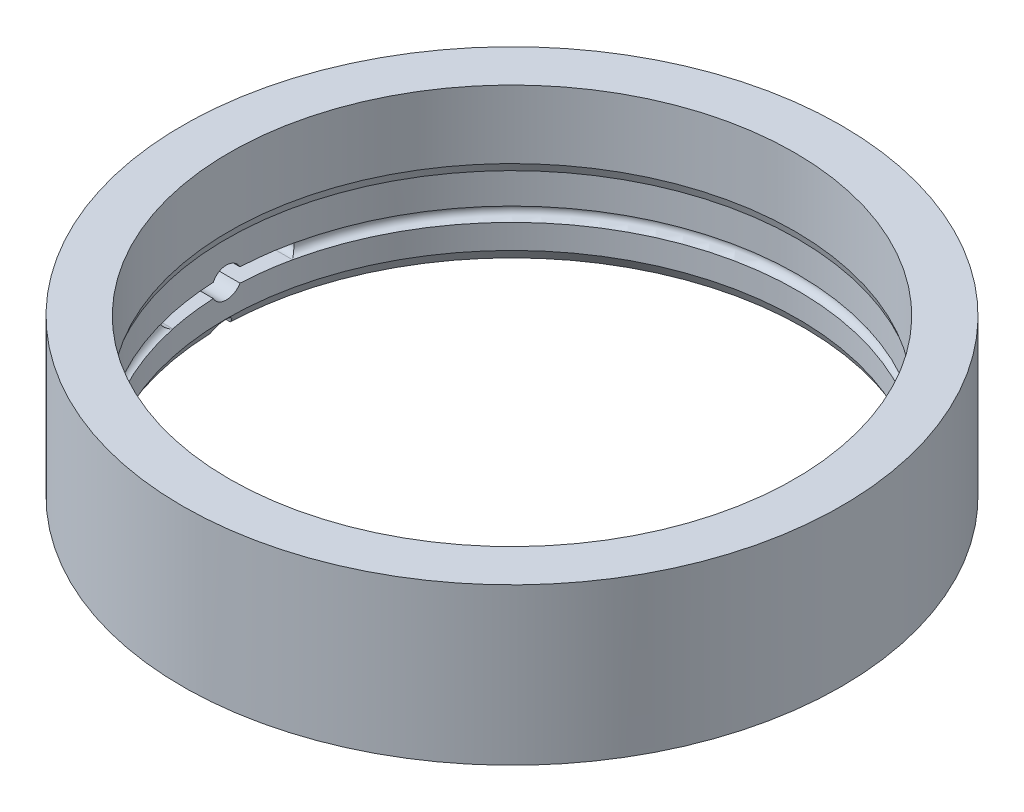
ISO-10303-21;
HEADER;
FILE_DESCRIPTION(('STEP AP214'),'2;1');
FILE_NAME('part.step','',(''),(''),'','','');
FILE_SCHEMA(('AUTOMOTIVE_DESIGN { 1 0 10303 214 1 1 1 1 }'));
ENDSEC;
DATA;
#1=APPLICATION_CONTEXT('core data for automotive mechanical design processes');
#2=APPLICATION_PROTOCOL_DEFINITION('international standard','automotive_design',2000,#1);
#3=PRODUCT_CONTEXT('',#1,'mechanical');
#4=PRODUCT('Part','Part','',(#3));
#5=PRODUCT_RELATED_PRODUCT_CATEGORY('part','',(#4));
#6=PRODUCT_DEFINITION_FORMATION('','',#4);
#7=PRODUCT_DEFINITION_CONTEXT('part definition',#1,'design');
#8=PRODUCT_DEFINITION('design','',#6,#7);
#9=PRODUCT_DEFINITION_SHAPE('','',#8);
#10=(LENGTH_UNIT() NAMED_UNIT(*) SI_UNIT(.MILLI.,.METRE.));
#11=(NAMED_UNIT(*) PLANE_ANGLE_UNIT() SI_UNIT($,.RADIAN.));
#12=(NAMED_UNIT(*) SI_UNIT($,.STERADIAN.) SOLID_ANGLE_UNIT());
#13=UNCERTAINTY_MEASURE_WITH_UNIT(LENGTH_MEASURE(1.E-05),#10,'distance_accuracy_value','');
#14=(GEOMETRIC_REPRESENTATION_CONTEXT(3) GLOBAL_UNCERTAINTY_ASSIGNED_CONTEXT((#13)) GLOBAL_UNIT_ASSIGNED_CONTEXT((#10,
#11,#12)) REPRESENTATION_CONTEXT('',''));
#15=CARTESIAN_POINT('',(0.,0.,0.));
#16=DIRECTION('',(0.,0.,1.));
#17=DIRECTION('',(1.,0.,0.));
#18=AXIS2_PLACEMENT_3D('',#15,#16,#17);
#19=CARTESIAN_POINT('',(0.,0.,0.));
#20=DIRECTION('',(0.,-1.,0.));
#21=DIRECTION('',(0.,0.,-1.));
#22=AXIS2_PLACEMENT_3D('',#19,#20,#21);
#23=CYLINDRICAL_SURFACE('',#22,72.1106);
#24=CARTESIAN_POINT('',(0.,12.446,0.));
#25=DIRECTION('',(0.,-1.,0.));
#26=DIRECTION('',(0.,0.,-1.));
#27=AXIS2_PLACEMENT_3D('',#24,#25,#26);
#28=CIRCLE('',#27,72.1106);
#29=CARTESIAN_POINT('',(-70.5091190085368,12.446,15.113));
#30=VERTEX_POINT('',#29);
#31=CARTESIAN_POINT('',(-72.0318250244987,12.446,3.36969078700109));
#32=VERTEX_POINT('',#31);
#33=EDGE_CURVE('E273',#30,#32,#28,.T.);
#34=ORIENTED_EDGE('',*,*,#33,.T.);
#35=CARTESIAN_POINT('',(-72.0318250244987,12.446,-3.36969078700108));
#36=CARTESIAN_POINT('',(-72.034164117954,12.540810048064,-3.31967626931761));
#37=CARTESIAN_POINT('',(-72.0366400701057,12.6334923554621,-3.26564656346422));
#38=CARTESIAN_POINT('',(-72.0417908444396,12.8139703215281,-3.14998081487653));
#39=CARTESIAN_POINT('',(-72.0444656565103,12.90176622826,-3.08834515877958));
#40=CARTESIAN_POINT('',(-72.0499376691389,13.0717913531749,-2.95793135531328));
#41=CARTESIAN_POINT('',(-72.0527347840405,13.1540243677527,-2.889158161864));
#42=CARTESIAN_POINT('',(-72.058372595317,13.3123889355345,-2.74495750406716));
#43=CARTESIAN_POINT('',(-72.0612132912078,13.3885205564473,-2.66953011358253));
#44=CARTESIAN_POINT('',(-72.0696823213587,13.6070042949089,-2.43395328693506));
#45=CARTESIAN_POINT('',(-72.0752600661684,13.73951867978,-2.26445279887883));
#46=CARTESIAN_POINT('',(-72.0856370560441,13.9741085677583,-1.9057115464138));
#47=CARTESIAN_POINT('',(-72.0904364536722,14.0761900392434,-1.71647466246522));
#48=CARTESIAN_POINT('',(-72.0987202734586,14.2471405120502,-1.32352727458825));
#49=CARTESIAN_POINT('',(-72.1022049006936,14.3160146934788,-1.11981903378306));
#50=CARTESIAN_POINT('',(-72.1074666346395,14.4185821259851,-0.703684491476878));
#51=CARTESIAN_POINT('',(-72.1092435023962,14.4522704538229,-0.491256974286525));
#52=CARTESIAN_POINT('',(-72.1108875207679,14.4834705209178,-0.0640242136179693));
#53=CARTESIAN_POINT('',(-72.11075708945,14.4810280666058,0.150777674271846));
#54=CARTESIAN_POINT('',(-72.1086071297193,14.4401473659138,0.576899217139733));
#55=CARTESIAN_POINT('',(-72.1065877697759,14.401712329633,0.788219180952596));
#56=CARTESIAN_POINT('',(-72.100889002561,14.2899812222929,1.20129643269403));
#57=CARTESIAN_POINT('',(-72.0972103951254,14.2167019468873,1.40305827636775));
#58=CARTESIAN_POINT('',(-72.0886055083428,14.0373453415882,1.79147169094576));
#59=CARTESIAN_POINT('',(-72.0836789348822,13.9312602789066,1.97811968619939));
#60=CARTESIAN_POINT('',(-72.0731247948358,13.6891595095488,2.33122691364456));
#61=CARTESIAN_POINT('',(-72.0674961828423,13.5530989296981,2.49765529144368));
#62=CARTESIAN_POINT('',(-72.0561809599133,13.2550289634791,2.80519455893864));
#63=CARTESIAN_POINT('',(-72.0504944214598,13.093048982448,2.94633375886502));
#64=CARTESIAN_POINT('',(-72.0427437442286,12.8451778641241,3.1280628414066));
#65=CARTESIAN_POINT('',(-72.0404421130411,12.7677707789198,3.18053652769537));
#66=CARTESIAN_POINT('',(-72.0360014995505,12.6094511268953,3.27956607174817));
#67=CARTESIAN_POINT('',(-72.0338622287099,12.5285451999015,3.32613253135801));
#68=CARTESIAN_POINT('',(-72.0318250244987,12.446,3.36969078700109));
#69=B_SPLINE_CURVE_WITH_KNOTS('',3,(#35,#36,#37,#38,#39,#40,#41,#42,#43,#44,#45,#46,#47,#48,#49,
#50,#51,#52,#53,#54,#55,#56,#57,#58,#59,#60,#61,#62,#63,#64,#65,#66,#67,#68),.UNSPECIFIED.,.F.,
.F.,(4,2,2,2,2,2,2,2,2,2,2,2,2,2,2,2,4),(0.,0.321551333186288,0.643086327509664,
0.964399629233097,1.28570936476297,1.92805456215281,2.57027370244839,3.21239262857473,
3.85460138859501,4.49599602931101,5.13733347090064,5.77836208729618,6.41954191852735,
7.06168819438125,7.70311105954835,7.9835369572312,8.26345222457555),.UNSPECIFIED.);
#70=CARTESIAN_POINT('',(-72.0318250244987,12.446,-3.36969078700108));
#71=VERTEX_POINT('',#70);
#72=EDGE_CURVE('E141',#71,#32,#69,.T.);
#73=ORIENTED_EDGE('',*,*,#72,.F.);
#74=CARTESIAN_POINT('',(0.,12.446,0.));
#75=DIRECTION('',(0.,-1.,0.));
#76=DIRECTION('',(0.,0.,-1.));
#77=AXIS2_PLACEMENT_3D('',#74,#75,#76);
#78=CIRCLE('',#77,72.1106);
#79=CARTESIAN_POINT('',(-70.5091190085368,12.446,-15.113));
#80=VERTEX_POINT('',#79);
#81=EDGE_CURVE('E153',#71,#80,#78,.T.);
#82=ORIENTED_EDGE('',*,*,#81,.T.);
#83=EDGE_CURVE('E126',#80,#30,#28,.T.);
#84=ORIENTED_EDGE('',*,*,#83,.T.);
#85=EDGE_LOOP('',(#34,#73,#82,#84));
#86=FACE_BOUND('',#85,.T.);
#87=CARTESIAN_POINT('',(0.,20.193,0.));
#88=DIRECTION('',(0.,-1.,0.));
#89=DIRECTION('',(0.,0.,-1.));
#90=AXIS2_PLACEMENT_3D('',#87,#88,#89);
#91=CIRCLE('',#90,72.1106);
#92=CARTESIAN_POINT('',(0.,20.193,-72.1106));
#93=VERTEX_POINT('',#92);
#94=EDGE_CURVE('E11',#93,#93,#91,.T.);
#95=ORIENTED_EDGE('',*,*,#94,.F.);
#96=EDGE_LOOP('',(#95));
#97=FACE_BOUND('',#96,.T.);
#98=ADVANCED_FACE('F34',(#86,#97),#23,.F.);
#99=CARTESIAN_POINT('',(0.,0.,0.));
#100=DIRECTION('',(0.,1.,0.));
#101=DIRECTION('',(0.,0.,1.));
#102=AXIS2_PLACEMENT_3D('',#99,#100,#101);
#103=PLANE('',#102);
#104=CARTESIAN_POINT('',(0.,0.,0.));
#105=DIRECTION('',(0.,1.,0.));
#106=DIRECTION('',(0.,0.,1.));
#107=AXIS2_PLACEMENT_3D('',#104,#105,#106);
#108=CIRCLE('',#107,73.6980999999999);
#109=CARTESIAN_POINT('',(-73.6543165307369,0.,2.54));
#110=VERTEX_POINT('',#109);
#111=CARTESIAN_POINT('',(-73.6543165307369,0.,-2.54));
#112=VERTEX_POINT('',#111);
#113=EDGE_CURVE('E284',#110,#112,#108,.T.);
#114=ORIENTED_EDGE('',*,*,#113,.T.);
#115=DIRECTION('',(-1.,0.,0.));
#116=VECTOR('',#115,1.);
#117=CARTESIAN_POINT('',(83.186,0.,-2.54));
#118=LINE('',#117,#116);
#119=CARTESIAN_POINT('',(-83.1462123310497,0.,-2.54));
#120=VERTEX_POINT('',#119);
#121=EDGE_CURVE('E170',#112,#120,#118,.T.);
#122=ORIENTED_EDGE('',*,*,#121,.T.);
#123=CARTESIAN_POINT('',(0.,0.,0.));
#124=DIRECTION('',(0.,1.,0.));
#125=DIRECTION('',(0.,0.,1.));
#126=AXIS2_PLACEMENT_3D('',#123,#124,#125);
#127=CIRCLE('',#126,83.185);
#128=CARTESIAN_POINT('',(-83.1462123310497,0.,2.54));
#129=VERTEX_POINT('',#128);
#130=EDGE_CURVE('E278',#129,#120,#127,.T.);
#131=ORIENTED_EDGE('',*,*,#130,.F.);
#132=DIRECTION('',(-1.,0.,0.));
#133=VECTOR('',#132,1.);
#134=CARTESIAN_POINT('',(83.186,0.,2.54));
#135=LINE('',#134,#133);
#136=EDGE_CURVE('E256',#110,#129,#135,.T.);
#137=ORIENTED_EDGE('',*,*,#136,.F.);
#138=EDGE_LOOP('',(#114,#122,#131,#137));
#139=FACE_BOUND('',#138,.T.);
#140=ADVANCED_FACE('F194',(#139),#103,.F.);
#141=CARTESIAN_POINT('',(0.,29.2862,0.));
#142=DIRECTION('',(0.,-1.,0.));
#143=DIRECTION('',(0.,0.,-1.));
#144=AXIS2_PLACEMENT_3D('',#141,#142,#143);
#145=CYLINDRICAL_SURFACE('',#144,83.185);
#146=CARTESIAN_POINT('',(0.,8.89000000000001,0.));
#147=DIRECTION('',(0.,-1.,0.));
#148=DIRECTION('',(0.,0.,-1.));
#149=AXIS2_PLACEMENT_3D('',#146,#147,#148);
#150=CIRCLE('',#149,83.185);
#151=CARTESIAN_POINT('',(-81.8006201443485,8.89000000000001,15.113));
#152=VERTEX_POINT('',#151);
#153=CARTESIAN_POINT('',(-83.1167215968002,8.89000000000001,3.36969078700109));
#154=VERTEX_POINT('',#153);
#155=EDGE_CURVE('E255',#152,#154,#150,.T.);
#156=ORIENTED_EDGE('',*,*,#155,.T.);
#157=CARTESIAN_POINT('',(-83.0977022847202,10.668,3.81));
#158=CARTESIAN_POINT('',(-83.0977034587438,10.4541110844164,3.80999055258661));
#159=CARTESIAN_POINT('',(-83.0985369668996,10.2400699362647,3.79192830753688));
#160=CARTESIAN_POINT('',(-83.1017815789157,9.81789070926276,3.72012970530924));
#161=CARTESIAN_POINT('',(-83.1041945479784,9.60975991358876,3.66635116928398));
#162=CARTESIAN_POINT('',(-83.110324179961,9.2055782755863,3.52466155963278));
#163=CARTESIAN_POINT('',(-83.1140401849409,9.00952139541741,3.43676770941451));
#164=CARTESIAN_POINT('',(-83.1223563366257,8.63499808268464,3.22936846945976));
#165=CARTESIAN_POINT('',(-83.1269562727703,8.45652747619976,3.10987060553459));
#166=CARTESIAN_POINT('',(-83.1365265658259,8.12203353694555,2.84253851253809));
#167=CARTESIAN_POINT('',(-83.1414972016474,7.96602737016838,2.69468281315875));
#168=CARTESIAN_POINT('',(-83.1512461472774,7.68103683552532,2.37487432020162));
#169=CARTESIAN_POINT('',(-83.1560244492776,7.55205356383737,2.20292054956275));
#170=CARTESIAN_POINT('',(-83.1648522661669,7.32472578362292,1.83971084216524));
#171=CARTESIAN_POINT('',(-83.1689014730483,7.2263942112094,1.64844680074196));
#172=CARTESIAN_POINT('',(-83.1758120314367,7.06324425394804,1.25210299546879));
#173=CARTESIAN_POINT('',(-83.1786733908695,6.99842564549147,1.04702332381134));
#174=CARTESIAN_POINT('',(-83.1828839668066,6.90418573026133,0.629023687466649));
#175=CARTESIAN_POINT('',(-83.1842342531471,6.87473937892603,0.41610938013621));
#176=CARTESIAN_POINT('',(-83.1852740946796,6.85200258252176,-0.0116441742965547));
#177=CARTESIAN_POINT('',(-83.1849636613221,6.85871188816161,-0.226483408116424));
#178=CARTESIAN_POINT('',(-83.1827179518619,6.9080751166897,-0.651818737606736));
#179=CARTESIAN_POINT('',(-83.1807838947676,6.95070207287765,-0.862317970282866));
#180=CARTESIAN_POINT('',(-83.175510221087,7.07064879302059,-1.27316980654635));
#181=CARTESIAN_POINT('',(-83.1721705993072,7.14796868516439,-1.47352237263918));
#182=CARTESIAN_POINT('',(-83.1644599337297,7.33513725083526,-1.85848047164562));
#183=CARTESIAN_POINT('',(-83.1600884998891,7.44499822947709,-2.04308001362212));
#184=CARTESIAN_POINT('',(-83.1508065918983,7.69412140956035,-2.39122644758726));
#185=CARTESIAN_POINT('',(-83.1458961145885,7.83338378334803,-2.55477321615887));
#186=CARTESIAN_POINT('',(-83.136083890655,8.13750909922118,-2.85632885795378));
#187=CARTESIAN_POINT('',(-83.1311821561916,8.30239543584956,-2.99431413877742));
#188=CARTESIAN_POINT('',(-83.1219445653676,8.65300590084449,-3.24064819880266));
#189=CARTESIAN_POINT('',(-83.1176087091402,8.8387300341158,-3.34899697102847));
#190=CARTESIAN_POINT('',(-83.1099921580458,9.22575807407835,-3.53298021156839));
#191=CARTESIAN_POINT('',(-83.1067114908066,9.42706238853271,-3.60861382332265));
#192=CARTESIAN_POINT('',(-83.1015763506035,9.83953018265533,-3.72500417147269));
#193=CARTESIAN_POINT('',(-83.0997218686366,10.0506936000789,-3.76576112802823));
#194=CARTESIAN_POINT('',(-83.0976498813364,10.4766799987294,-3.81121210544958));
#195=CARTESIAN_POINT('',(-83.0974308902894,10.691499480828,-3.81593885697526));
#196=CARTESIAN_POINT('',(-83.0986507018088,11.1188806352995,-3.78928063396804));
#197=CARTESIAN_POINT('',(-83.1000894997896,11.3314423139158,-3.75789575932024));
#198=CARTESIAN_POINT('',(-83.1044613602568,11.7481822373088,-3.6599323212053));
#199=CARTESIAN_POINT('',(-83.1073937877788,11.9523640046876,-3.59336871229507));
#200=CARTESIAN_POINT('',(-83.114421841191,12.3466565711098,-3.42695243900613));
#201=CARTESIAN_POINT('',(-83.1185174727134,12.5367673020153,-3.32709961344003));
#202=CARTESIAN_POINT('',(-83.1274139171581,12.8976718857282,-3.09685526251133));
#203=CARTESIAN_POINT('',(-83.1322152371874,13.0684516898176,-2.96644173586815));
#204=CARTESIAN_POINT('',(-83.1419800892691,13.3857053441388,-2.67881012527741));
#205=CARTESIAN_POINT('',(-83.1469436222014,13.5321790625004,-2.521591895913));
#206=CARTESIAN_POINT('',(-83.1564777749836,13.7967725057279,-2.18467323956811));
#207=CARTESIAN_POINT('',(-83.1610481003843,13.9148710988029,-2.00495620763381));
#208=CARTESIAN_POINT('',(-83.169276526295,14.1192174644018,-1.62822553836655));
#209=CARTESIAN_POINT('',(-83.1729346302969,14.2054653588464,-1.43121196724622));
#210=CARTESIAN_POINT('',(-83.1789249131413,14.3436250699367,-1.02555958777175));
#211=CARTESIAN_POINT('',(-83.1812576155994,14.3955504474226,-0.816925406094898));
#212=CARTESIAN_POINT('',(-83.1843362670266,14.4636355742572,-0.39388923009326));
#213=CARTESIAN_POINT('',(-83.1850822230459,14.4797954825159,-0.179487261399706));
#214=CARTESIAN_POINT('',(-83.1849033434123,14.4758893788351,0.248788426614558));
#215=CARTESIAN_POINT('',(-83.183980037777,14.4558565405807,0.462662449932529));
#216=CARTESIAN_POINT('',(-83.1805696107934,14.3802021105,0.884007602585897));
#217=CARTESIAN_POINT('',(-83.1780824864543,14.3245804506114,1.09147871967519));
#218=CARTESIAN_POINT('',(-83.1718243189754,14.1793337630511,1.49413645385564));
#219=CARTESIAN_POINT('',(-83.1680532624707,14.0897083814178,1.68932294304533));
#220=CARTESIAN_POINT('',(-83.1596515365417,13.8790047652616,2.06187903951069));
#221=CARTESIAN_POINT('',(-83.1550208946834,13.7579275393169,2.23924921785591));
#222=CARTESIAN_POINT('',(-83.1454165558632,13.4876406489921,2.57130208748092));
#223=CARTESIAN_POINT('',(-83.1404425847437,13.3384083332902,2.72596633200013));
#224=CARTESIAN_POINT('',(-83.1307138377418,13.0160533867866,3.00809348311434));
#225=CARTESIAN_POINT('',(-83.1259591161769,12.8429248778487,3.13554967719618));
#226=CARTESIAN_POINT('',(-83.1172023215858,12.4775731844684,3.35969283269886));
#227=CARTESIAN_POINT('',(-83.1132009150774,12.2853333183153,3.45635259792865));
#228=CARTESIAN_POINT('',(-83.1064128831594,11.887480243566,3.61590934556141));
#229=CARTESIAN_POINT('',(-83.1036248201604,11.6818831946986,3.6788463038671));
#230=CARTESIAN_POINT('',(-83.1003178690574,11.3405027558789,3.75261940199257));
#231=CARTESIAN_POINT('',(-83.099341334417,11.2069317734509,3.77410975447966));
#232=CARTESIAN_POINT('',(-83.0980331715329,10.9382607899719,3.80280303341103));
#233=CARTESIAN_POINT('',(-83.0977015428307,10.8031607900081,3.81000597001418));
#234=CARTESIAN_POINT('',(-83.0977022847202,10.668,3.81));
#235=B_SPLINE_CURVE_WITH_KNOTS('',3,(#157,#158,#159,#160,#161,#162,#163,#164,#165,#166,#167,
#168,#169,#170,#171,#172,#173,#174,#175,#176,#177,#178,#179,#180,#181,#182,#183,#184,#185,#186,
#187,#188,#189,#190,#191,#192,#193,#194,#195,#196,#197,#198,#199,#200,#201,#202,#203,#204,#205,
#206,#207,#208,#209,#210,#211,#212,#213,#214,#215,#216,#217,#218,#219,#220,#221,#222,#223,#224,
#225,#226,#227,#228,#229,#230,#231,#232,#233,#234),.UNSPECIFIED.,.T.,.F.,(4,2,2,2,2,2,2,2,2,2,2,
2,2,2,2,2,2,2,2,2,2,2,2,2,2,2,2,2,2,2,2,2,2,2,2,2,2,2,4),(0.,0.641173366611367,1.28310527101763,
1.92471351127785,2.56616910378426,3.20811228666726,3.85008150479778,4.49232129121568,
5.13455679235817,5.77633730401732,6.41811339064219,7.05940806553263,7.70070510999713,
8.34224496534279,8.98378858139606,9.62592140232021,10.2680543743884,10.9102041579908,
11.5523498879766,12.1939122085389,12.8354727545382,13.4767607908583,14.1180519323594,
14.7598061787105,15.4015639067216,16.043798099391,16.6860298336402,17.3280076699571,
17.9699826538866,18.6113695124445,19.252757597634,19.8941523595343,20.5355265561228,
21.1774189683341,21.8194695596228,22.4620855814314,23.1039381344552,23.5091090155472,
23.9142796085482),.UNSPECIFIED.);
#236=CARTESIAN_POINT('',(-83.1167215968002,8.89000000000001,-3.36969078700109));
#237=VERTEX_POINT('',#236);
#238=EDGE_CURVE('E133',#154,#237,#235,.T.);
#239=ORIENTED_EDGE('',*,*,#238,.T.);
#240=CARTESIAN_POINT('',(0.,8.89000000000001,0.));
#241=DIRECTION('',(0.,-1.,0.));
#242=DIRECTION('',(0.,0.,-1.));
#243=AXIS2_PLACEMENT_3D('',#240,#241,#242);
#244=CIRCLE('',#243,83.185);
#245=CARTESIAN_POINT('',(-81.8006201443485,8.89000000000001,-15.113));
#246=VERTEX_POINT('',#245);
#247=EDGE_CURVE('E240',#237,#246,#244,.T.);
#248=ORIENTED_EDGE('',*,*,#247,.T.);
#249=CARTESIAN_POINT('',(-82.1092077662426,10.668,-13.335));
#250=CARTESIAN_POINT('',(-82.1092071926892,10.5691227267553,-13.3350045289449));
#251=CARTESIAN_POINT('',(-82.1078647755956,10.4701733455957,-13.3432775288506));
#252=CARTESIAN_POINT('',(-82.1025164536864,10.2750154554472,-13.3761460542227));
#253=CARTESIAN_POINT('',(-82.0985073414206,10.1788103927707,-13.4007612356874));
#254=CARTESIAN_POINT('',(-82.0879054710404,9.99201323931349,-13.4655512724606));
#255=CARTESIAN_POINT('',(-82.0813145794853,9.90141714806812,-13.5057148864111));
#256=CARTESIAN_POINT('',(-82.0656821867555,9.72832234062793,-13.6003794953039));
#257=CARTESIAN_POINT('',(-82.0566412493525,9.64582176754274,-13.6548771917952));
#258=CARTESIAN_POINT('',(-82.0362386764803,9.49072755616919,-13.7769229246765));
#259=CARTESIAN_POINT('',(-82.0248649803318,9.41818881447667,-13.8445386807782));
#260=CARTESIAN_POINT('',(-82.0000687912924,9.28547750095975,-13.9906548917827));
#261=CARTESIAN_POINT('',(-81.9866461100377,9.22530606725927,-14.0691563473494));
#262=CARTESIAN_POINT('',(-81.9578708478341,9.11822930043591,-14.2358301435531));
#263=CARTESIAN_POINT('',(-81.94249637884,9.07149791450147,-14.3241104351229));
#264=CARTESIAN_POINT('',(-81.9103134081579,8.99350028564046,-14.5070120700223));
#265=CARTESIAN_POINT('',(-81.8935047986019,8.96223520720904,-14.6016338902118));
#266=CARTESIAN_POINT('',(-81.8586210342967,8.91560463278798,-14.7959542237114));
#267=CARTESIAN_POINT('',(-81.8405313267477,8.90047030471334,-14.8957056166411));
#268=CARTESIAN_POINT('',(-81.8037803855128,8.88724145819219,-15.0962290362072));
#269=CARTESIAN_POINT('',(-81.7851191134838,8.88914808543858,-15.1970011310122));
#270=CARTESIAN_POINT('',(-81.7475523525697,8.91002878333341,-15.3978066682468));
#271=CARTESIAN_POINT('',(-81.7286463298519,8.92917866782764,-15.4978217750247));
#272=CARTESIAN_POINT('',(-81.6913519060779,8.98427393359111,-15.6932198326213));
#273=CARTESIAN_POINT('',(-81.672963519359,9.0202197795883,-15.7886026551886));
#274=CARTESIAN_POINT('',(-81.6372813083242,9.10799416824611,-15.9720779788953));
#275=CARTESIAN_POINT('',(-81.6199883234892,9.15983471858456,-16.0601649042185));
#276=CARTESIAN_POINT('',(-81.5871074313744,9.27801024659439,-16.2263771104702));
#277=CARTESIAN_POINT('',(-81.571519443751,9.3443445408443,-16.3045028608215));
#278=CARTESIAN_POINT('',(-81.5427847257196,9.48887536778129,-16.4476066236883));
#279=CARTESIAN_POINT('',(-81.52961255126,9.56693035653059,-16.5127224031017));
#280=CARTESIAN_POINT('',(-81.5060033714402,9.73326909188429,-16.6288653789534));
#281=CARTESIAN_POINT('',(-81.4955660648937,9.8215517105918,-16.6798941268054));
#282=CARTESIAN_POINT('',(-81.4780199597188,10.0040387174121,-16.7653919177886));
#283=CARTESIAN_POINT('',(-81.4708515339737,10.0980982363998,-16.8001579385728));
#284=CARTESIAN_POINT('',(-81.4598492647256,10.2909002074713,-16.8534248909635));
#285=CARTESIAN_POINT('',(-81.4560150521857,10.3896421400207,-16.8719276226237));
#286=CARTESIAN_POINT('',(-81.4518776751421,10.587213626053,-16.8918900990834));
#287=CARTESIAN_POINT('',(-81.451515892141,10.6860134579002,-16.8936327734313));
#288=CARTESIAN_POINT('',(-81.4541851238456,10.8824912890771,-16.8807580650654));
#289=CARTESIAN_POINT('',(-81.4572159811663,10.980169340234,-16.8661414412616));
#290=CARTESIAN_POINT('',(-81.4665217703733,11.1711240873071,-16.8211347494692));
#291=CARTESIAN_POINT('',(-81.4727800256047,11.264420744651,-16.790825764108));
#292=CARTESIAN_POINT('',(-81.4882829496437,11.4445649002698,-16.7154252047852));
#293=CARTESIAN_POINT('',(-81.4975277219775,11.5314121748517,-16.6703331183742));
#294=CARTESIAN_POINT('',(-81.5187521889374,11.6971055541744,-16.5662338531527));
#295=CARTESIAN_POINT('',(-81.5307568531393,11.7758684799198,-16.5070994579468));
#296=CARTESIAN_POINT('',(-81.5570107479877,11.9223787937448,-16.3768929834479));
#297=CARTESIAN_POINT('',(-81.5712601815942,11.9901251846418,-16.3058198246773));
#298=CARTESIAN_POINT('',(-81.6017912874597,12.1140148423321,-16.1523405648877));
#299=CARTESIAN_POINT('',(-81.6181055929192,12.1699210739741,-16.0697496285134));
#300=CARTESIAN_POINT('',(-81.6520056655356,12.2670965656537,-15.896602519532));
#301=CARTESIAN_POINT('',(-81.6695915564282,12.3083643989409,-15.8060455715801));
#302=CARTESIAN_POINT('',(-81.7057998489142,12.3758131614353,-15.6178050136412));
#303=CARTESIAN_POINT('',(-81.7244350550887,12.4017154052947,-15.5200239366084));
#304=CARTESIAN_POINT('',(-81.7618827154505,12.4366041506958,-15.3215195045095));
#305=CARTESIAN_POINT('',(-81.7806951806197,12.4455895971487,-15.2207959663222));
#306=CARTESIAN_POINT('',(-81.8181153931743,12.4463861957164,-15.0183521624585));
#307=CARTESIAN_POINT('',(-81.8367200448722,12.4380508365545,-14.916630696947));
#308=CARTESIAN_POINT('',(-81.8730445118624,12.4040852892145,-14.7159508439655));
#309=CARTESIAN_POINT('',(-81.8907643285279,12.3784551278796,-14.6169924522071));
#310=CARTESIAN_POINT('',(-81.9247962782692,12.3106524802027,-14.425028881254));
#311=CARTESIAN_POINT('',(-81.9411128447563,12.2685346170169,-14.3320052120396));
#312=CARTESIAN_POINT('',(-81.9719936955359,12.1688599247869,-14.1543143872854));
#313=CARTESIAN_POINT('',(-81.9865581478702,12.1113045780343,-14.0696464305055));
#314=CARTESIAN_POINT('',(-82.0134240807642,11.9831065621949,-13.9121821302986));
#315=CARTESIAN_POINT('',(-82.0257505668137,11.9126288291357,-13.8392557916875));
#316=CARTESIAN_POINT('',(-82.0480771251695,11.7600764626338,-13.7062695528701));
#317=CARTESIAN_POINT('',(-82.058076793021,11.6779998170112,-13.6462118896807));
#318=CARTESIAN_POINT('',(-82.0754067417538,11.505831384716,-13.5415883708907));
#319=CARTESIAN_POINT('',(-82.0827720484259,11.415866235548,-13.4968196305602));
#320=CARTESIAN_POINT('',(-82.0948660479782,11.2296069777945,-13.4230624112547));
#321=CARTESIAN_POINT('',(-82.0995981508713,11.1333212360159,-13.3940535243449));
#322=CARTESIAN_POINT('',(-82.1050447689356,10.9749840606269,-13.3606138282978));
#323=CARTESIAN_POINT('',(-82.1066044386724,10.9140031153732,-13.3510215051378));
#324=CARTESIAN_POINT('',(-82.1086861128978,10.7913574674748,-13.3382131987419));
#325=CARTESIAN_POINT('',(-82.1092081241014,10.7296927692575,-13.3349971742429));
#326=CARTESIAN_POINT('',(-82.1092077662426,10.668,-13.335));
#327=B_SPLINE_CURVE_WITH_KNOTS('',3,(#249,#250,#251,#252,#253,#254,#255,#256,#257,#258,#259,
#260,#261,#262,#263,#264,#265,#266,#267,#268,#269,#270,#271,#272,#273,#274,#275,#276,#277,#278,
#279,#280,#281,#282,#283,#284,#285,#286,#287,#288,#289,#290,#291,#292,#293,#294,#295,#296,#297,
#298,#299,#300,#301,#302,#303,#304,#305,#306,#307,#308,#309,#310,#311,#312,#313,#314,#315,#316,
#317,#318,#319,#320,#321,#322,#323,#324,#325,#326),.UNSPECIFIED.,.T.,.F.,(4,2,2,2,2,2,2,2,2,2,2,
2,2,2,2,2,2,2,2,2,2,2,2,2,2,2,2,2,2,2,2,2,2,2,2,2,2,2,4),(0.,0.296405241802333,
0.593167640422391,0.889715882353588,1.18619594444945,1.48424934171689,1.78233015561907,
2.08411112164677,2.38591480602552,2.69198773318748,2.99808123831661,3.30733148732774,
3.61659029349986,3.92608330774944,4.23556173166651,4.54156551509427,4.84753558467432,
5.14767621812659,5.44778362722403,5.74281579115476,6.03783426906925,6.33134337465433,
6.62486265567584,6.9211499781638,7.21746410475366,7.51924305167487,7.82105140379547,
8.12817838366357,8.43532451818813,8.74507927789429,9.05483355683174,9.36357019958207,
9.67227720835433,9.97728826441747,10.2823522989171,10.5831946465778,10.8836464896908,
11.0685846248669,11.2535215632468),.UNSPECIFIED.);
#328=CARTESIAN_POINT('',(-81.8006201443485,12.446,-15.113));
#329=VERTEX_POINT('',#328);
#330=EDGE_CURVE('E214',#246,#329,#327,.T.);
#331=ORIENTED_EDGE('',*,*,#330,.T.);
#332=CARTESIAN_POINT('',(0.,12.446,0.));
#333=DIRECTION('',(0.,-1.,0.));
#334=DIRECTION('',(0.,0.,-1.));
#335=AXIS2_PLACEMENT_3D('',#332,#333,#334);
#336=CIRCLE('',#335,83.185);
#337=CARTESIAN_POINT('',(-83.1167215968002,12.446,-3.36969078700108));
#338=VERTEX_POINT('',#337);
#339=EDGE_CURVE('E186',#338,#329,#336,.T.);
#340=ORIENTED_EDGE('',*,*,#339,.F.);
#341=CARTESIAN_POINT('',(-83.0977022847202,10.668,3.81));
#342=CARTESIAN_POINT('',(-83.0977034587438,10.4541110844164,3.80999055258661));
#343=CARTESIAN_POINT('',(-83.0985369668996,10.2400699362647,3.79192830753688));
#344=CARTESIAN_POINT('',(-83.1017815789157,9.81789070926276,3.72012970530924));
#345=CARTESIAN_POINT('',(-83.1041945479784,9.60975991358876,3.66635116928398));
#346=CARTESIAN_POINT('',(-83.110324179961,9.2055782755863,3.52466155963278));
#347=CARTESIAN_POINT('',(-83.1140401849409,9.00952139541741,3.43676770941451));
#348=CARTESIAN_POINT('',(-83.1223563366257,8.63499808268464,3.22936846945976));
#349=CARTESIAN_POINT('',(-83.1269562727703,8.45652747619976,3.10987060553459));
#350=CARTESIAN_POINT('',(-83.1365265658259,8.12203353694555,2.84253851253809));
#351=CARTESIAN_POINT('',(-83.1414972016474,7.96602737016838,2.69468281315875));
#352=CARTESIAN_POINT('',(-83.1512461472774,7.68103683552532,2.37487432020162));
#353=CARTESIAN_POINT('',(-83.1560244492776,7.55205356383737,2.20292054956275));
#354=CARTESIAN_POINT('',(-83.1648522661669,7.32472578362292,1.83971084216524));
#355=CARTESIAN_POINT('',(-83.1689014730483,7.2263942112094,1.64844680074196));
#356=CARTESIAN_POINT('',(-83.1758120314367,7.06324425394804,1.25210299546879));
#357=CARTESIAN_POINT('',(-83.1786733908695,6.99842564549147,1.04702332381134));
#358=CARTESIAN_POINT('',(-83.1828839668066,6.90418573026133,0.629023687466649));
#359=CARTESIAN_POINT('',(-83.1842342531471,6.87473937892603,0.41610938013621));
#360=CARTESIAN_POINT('',(-83.1852740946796,6.85200258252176,-0.0116441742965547));
#361=CARTESIAN_POINT('',(-83.1849636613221,6.85871188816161,-0.226483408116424));
#362=CARTESIAN_POINT('',(-83.1827179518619,6.9080751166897,-0.651818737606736));
#363=CARTESIAN_POINT('',(-83.1807838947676,6.95070207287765,-0.862317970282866));
#364=CARTESIAN_POINT('',(-83.175510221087,7.07064879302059,-1.27316980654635));
#365=CARTESIAN_POINT('',(-83.1721705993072,7.14796868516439,-1.47352237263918));
#366=CARTESIAN_POINT('',(-83.1644599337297,7.33513725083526,-1.85848047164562));
#367=CARTESIAN_POINT('',(-83.1600884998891,7.44499822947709,-2.04308001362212));
#368=CARTESIAN_POINT('',(-83.1508065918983,7.69412140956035,-2.39122644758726));
#369=CARTESIAN_POINT('',(-83.1458961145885,7.83338378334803,-2.55477321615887));
#370=CARTESIAN_POINT('',(-83.136083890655,8.13750909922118,-2.85632885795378));
#371=CARTESIAN_POINT('',(-83.1311821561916,8.30239543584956,-2.99431413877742));
#372=CARTESIAN_POINT('',(-83.1219445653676,8.65300590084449,-3.24064819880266));
#373=CARTESIAN_POINT('',(-83.1176087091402,8.8387300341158,-3.34899697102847));
#374=CARTESIAN_POINT('',(-83.1099921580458,9.22575807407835,-3.53298021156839));
#375=CARTESIAN_POINT('',(-83.1067114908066,9.42706238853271,-3.60861382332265));
#376=CARTESIAN_POINT('',(-83.1015763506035,9.83953018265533,-3.72500417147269));
#377=CARTESIAN_POINT('',(-83.0997218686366,10.0506936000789,-3.76576112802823));
#378=CARTESIAN_POINT('',(-83.0976498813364,10.4766799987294,-3.81121210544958));
#379=CARTESIAN_POINT('',(-83.0974308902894,10.691499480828,-3.81593885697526));
#380=CARTESIAN_POINT('',(-83.0986507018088,11.1188806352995,-3.78928063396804));
#381=CARTESIAN_POINT('',(-83.1000894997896,11.3314423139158,-3.75789575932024));
#382=CARTESIAN_POINT('',(-83.1044613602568,11.7481822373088,-3.6599323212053));
#383=CARTESIAN_POINT('',(-83.1073937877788,11.9523640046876,-3.59336871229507));
#384=CARTESIAN_POINT('',(-83.114421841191,12.3466565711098,-3.42695243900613));
#385=CARTESIAN_POINT('',(-83.1185174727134,12.5367673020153,-3.32709961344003));
#386=CARTESIAN_POINT('',(-83.1274139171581,12.8976718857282,-3.09685526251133));
#387=CARTESIAN_POINT('',(-83.1322152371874,13.0684516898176,-2.96644173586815));
#388=CARTESIAN_POINT('',(-83.1419800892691,13.3857053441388,-2.67881012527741));
#389=CARTESIAN_POINT('',(-83.1469436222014,13.5321790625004,-2.521591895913));
#390=CARTESIAN_POINT('',(-83.1564777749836,13.7967725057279,-2.18467323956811));
#391=CARTESIAN_POINT('',(-83.1610481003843,13.9148710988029,-2.00495620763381));
#392=CARTESIAN_POINT('',(-83.169276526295,14.1192174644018,-1.62822553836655));
#393=CARTESIAN_POINT('',(-83.1729346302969,14.2054653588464,-1.43121196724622));
#394=CARTESIAN_POINT('',(-83.1789249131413,14.3436250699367,-1.02555958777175));
#395=CARTESIAN_POINT('',(-83.1812576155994,14.3955504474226,-0.816925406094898));
#396=CARTESIAN_POINT('',(-83.1843362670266,14.4636355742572,-0.39388923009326));
#397=CARTESIAN_POINT('',(-83.1850822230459,14.4797954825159,-0.179487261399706));
#398=CARTESIAN_POINT('',(-83.1849033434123,14.4758893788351,0.248788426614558));
#399=CARTESIAN_POINT('',(-83.183980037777,14.4558565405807,0.462662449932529));
#400=CARTESIAN_POINT('',(-83.1805696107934,14.3802021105,0.884007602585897));
#401=CARTESIAN_POINT('',(-83.1780824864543,14.3245804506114,1.09147871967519));
#402=CARTESIAN_POINT('',(-83.1718243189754,14.1793337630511,1.49413645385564));
#403=CARTESIAN_POINT('',(-83.1680532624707,14.0897083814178,1.68932294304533));
#404=CARTESIAN_POINT('',(-83.1596515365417,13.8790047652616,2.06187903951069));
#405=CARTESIAN_POINT('',(-83.1550208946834,13.7579275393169,2.23924921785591));
#406=CARTESIAN_POINT('',(-83.1454165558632,13.4876406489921,2.57130208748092));
#407=CARTESIAN_POINT('',(-83.1404425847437,13.3384083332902,2.72596633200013));
#408=CARTESIAN_POINT('',(-83.1307138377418,13.0160533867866,3.00809348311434));
#409=CARTESIAN_POINT('',(-83.1259591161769,12.8429248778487,3.13554967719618));
#410=CARTESIAN_POINT('',(-83.1172023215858,12.4775731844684,3.35969283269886));
#411=CARTESIAN_POINT('',(-83.1132009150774,12.2853333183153,3.45635259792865));
#412=CARTESIAN_POINT('',(-83.1064128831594,11.887480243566,3.61590934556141));
#413=CARTESIAN_POINT('',(-83.1036248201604,11.6818831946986,3.6788463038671));
#414=CARTESIAN_POINT('',(-83.1003178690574,11.3405027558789,3.75261940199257));
#415=CARTESIAN_POINT('',(-83.099341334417,11.2069317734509,3.77410975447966));
#416=CARTESIAN_POINT('',(-83.0980331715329,10.9382607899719,3.80280303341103));
#417=CARTESIAN_POINT('',(-83.0977015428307,10.8031607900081,3.81000597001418));
#418=CARTESIAN_POINT('',(-83.0977022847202,10.668,3.81));
#419=B_SPLINE_CURVE_WITH_KNOTS('',3,(#341,#342,#343,#344,#345,#346,#347,#348,#349,#350,#351,
#352,#353,#354,#355,#356,#357,#358,#359,#360,#361,#362,#363,#364,#365,#366,#367,#368,#369,#370,
#371,#372,#373,#374,#375,#376,#377,#378,#379,#380,#381,#382,#383,#384,#385,#386,#387,#388,#389,
#390,#391,#392,#393,#394,#395,#396,#397,#398,#399,#400,#401,#402,#403,#404,#405,#406,#407,#408,
#409,#410,#411,#412,#413,#414,#415,#416,#417,#418),.UNSPECIFIED.,.T.,.F.,(4,2,2,2,2,2,2,2,2,2,2,
2,2,2,2,2,2,2,2,2,2,2,2,2,2,2,2,2,2,2,2,2,2,2,2,2,2,2,4),(0.,0.641173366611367,1.28310527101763,
1.92471351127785,2.56616910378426,3.20811228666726,3.85008150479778,4.49232129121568,
5.13455679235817,5.77633730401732,6.41811339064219,7.05940806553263,7.70070510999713,
8.34224496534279,8.98378858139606,9.62592140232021,10.2680543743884,10.9102041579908,
11.5523498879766,12.1939122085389,12.8354727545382,13.4767607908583,14.1180519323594,
14.7598061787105,15.4015639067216,16.043798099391,16.6860298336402,17.3280076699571,
17.9699826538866,18.6113695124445,19.252757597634,19.8941523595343,20.5355265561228,
21.1774189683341,21.8194695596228,22.4620855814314,23.1039381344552,23.5091090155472,
23.9142796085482),.UNSPECIFIED.);
#420=CARTESIAN_POINT('',(-83.1167215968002,12.446,3.36969078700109));
#421=VERTEX_POINT('',#420);
#422=EDGE_CURVE('E182',#338,#421,#419,.T.);
#423=ORIENTED_EDGE('',*,*,#422,.T.);
#424=CARTESIAN_POINT('',(0.,12.446,0.));
#425=DIRECTION('',(0.,-1.,0.));
#426=DIRECTION('',(0.,0.,-1.));
#427=AXIS2_PLACEMENT_3D('',#424,#425,#426);
#428=CIRCLE('',#427,83.185);
#429=CARTESIAN_POINT('',(-81.8006201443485,12.446,15.113));
#430=VERTEX_POINT('',#429);
#431=EDGE_CURVE('E220',#430,#421,#428,.T.);
#432=ORIENTED_EDGE('',*,*,#431,.F.);
#433=CARTESIAN_POINT('',(-81.4520616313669,10.668,16.891));
#434=CARTESIAN_POINT('',(-81.4520627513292,10.5696251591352,16.8909953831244));
#435=CARTESIAN_POINT('',(-81.4537623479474,10.4711781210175,16.8828052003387));
#436=CARTESIAN_POINT('',(-81.460497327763,10.2770257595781,16.850277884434));
#437=CARTESIAN_POINT('',(-81.4655367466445,10.1813238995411,16.8259212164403));
#438=CARTESIAN_POINT('',(-81.4787430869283,9.99553380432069,16.7618528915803));
#439=CARTESIAN_POINT('',(-81.4869070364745,9.90544032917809,16.7221558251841));
#440=CARTESIAN_POINT('',(-81.5060415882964,9.73327197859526,16.6286402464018));
#441=CARTESIAN_POINT('',(-81.5170116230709,9.65119548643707,16.5748245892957));
#442=CARTESIAN_POINT('',(-81.5414706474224,9.49645207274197,16.4540757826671));
#443=CARTESIAN_POINT('',(-81.5549832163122,9.42388499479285,16.387019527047));
#444=CARTESIAN_POINT('',(-81.5839733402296,9.29099371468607,16.2420741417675));
#445=CARTESIAN_POINT('',(-81.5994511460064,9.23067107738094,16.1641836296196));
#446=CARTESIAN_POINT('',(-81.6321661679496,9.12275735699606,15.998154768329));
#447=CARTESIAN_POINT('',(-81.6494315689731,9.07543437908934,15.9098476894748));
#448=CARTESIAN_POINT('',(-81.6849031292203,8.99629649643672,15.7267135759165));
#449=CARTESIAN_POINT('',(-81.7031093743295,8.96448301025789,15.6318859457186));
#450=CARTESIAN_POINT('',(-81.7401924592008,8.9168102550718,15.4368119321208));
#451=CARTESIAN_POINT('',(-81.7590753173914,8.90120564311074,15.3365043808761));
#452=CARTESIAN_POINT('',(-81.7966791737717,8.88725595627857,15.1346635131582));
#453=CARTESIAN_POINT('',(-81.81540016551,8.88891156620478,15.0331301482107));
#454=CARTESIAN_POINT('',(-81.8522455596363,8.90952764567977,14.8312071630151));
#455=CARTESIAN_POINT('',(-81.8703666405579,8.92857173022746,14.7308254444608));
#456=CARTESIAN_POINT('',(-81.9054295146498,8.98362270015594,14.5346062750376));
#457=CARTESIAN_POINT('',(-81.9223713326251,9.01962922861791,14.4387687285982));
#458=CARTESIAN_POINT('',(-81.9545366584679,9.10738431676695,14.2550620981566));
#459=CARTESIAN_POINT('',(-81.9697706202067,9.15902902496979,14.1671452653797));
#460=CARTESIAN_POINT('',(-81.9982764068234,9.27675548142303,14.0012138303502));
#461=CARTESIAN_POINT('',(-82.011548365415,9.34283624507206,13.9231985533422));
#462=CARTESIAN_POINT('',(-82.035659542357,9.48662642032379,13.7804199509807));
#463=CARTESIAN_POINT('',(-82.046528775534,9.56416943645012,13.7154941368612));
#464=CARTESIAN_POINT('',(-82.0658181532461,9.72933806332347,13.5996021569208));
#465=CARTESIAN_POINT('',(-82.0742384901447,9.81696288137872,13.5486348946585));
#466=CARTESIAN_POINT('',(-82.0883530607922,9.99849617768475,13.4628522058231));
#467=CARTESIAN_POINT('',(-82.0940834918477,10.0923006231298,13.4278225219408));
#468=CARTESIAN_POINT('',(-82.1028741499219,10.2845702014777,13.3739684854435));
#469=CARTESIAN_POINT('',(-82.1059345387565,10.3830350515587,13.3551431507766));
#470=CARTESIAN_POINT('',(-82.109308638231,10.5808226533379,13.3343830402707));
#471=CARTESIAN_POINT('',(-82.1096482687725,10.680128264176,13.3322888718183));
#472=CARTESIAN_POINT('',(-82.1076425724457,10.8776768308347,13.3446354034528));
#473=CARTESIAN_POINT('',(-82.1052973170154,10.9759198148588,13.3590756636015));
#474=CARTESIAN_POINT('',(-82.0979771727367,11.1682906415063,13.4039874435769));
#475=CARTESIAN_POINT('',(-82.0930092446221,11.2624286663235,13.4344165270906));
#476=CARTESIAN_POINT('',(-82.0805452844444,11.4442272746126,13.5103583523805));
#477=CARTESIAN_POINT('',(-82.0730492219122,11.5318877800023,13.5558712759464));
#478=CARTESIAN_POINT('',(-82.0556371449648,11.6987153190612,13.6608737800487));
#479=CARTESIAN_POINT('',(-82.0457097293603,11.7778397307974,13.7204291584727));
#480=CARTESIAN_POINT('',(-82.0236598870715,11.9249668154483,13.8516373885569));
#481=CARTESIAN_POINT('',(-82.0115373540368,11.9929689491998,13.9232908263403));
#482=CARTESIAN_POINT('',(-81.9852130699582,12.1167396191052,14.0774725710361));
#483=CARTESIAN_POINT('',(-81.97098991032,12.1723653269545,14.1601118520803));
#484=CARTESIAN_POINT('',(-81.9408895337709,12.2689788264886,14.3332676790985));
#485=CARTESIAN_POINT('',(-81.9250121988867,12.3099655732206,14.4237847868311));
#486=CARTESIAN_POINT('',(-81.8917459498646,12.3767492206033,14.6114808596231));
#487=CARTESIAN_POINT('',(-81.8743388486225,12.4023233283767,14.7087358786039));
#488=CARTESIAN_POINT('',(-81.8386535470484,12.4367469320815,14.9060074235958));
#489=CARTESIAN_POINT('',(-81.8203752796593,12.445595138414,15.0060241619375));
#490=CARTESIAN_POINT('',(-81.7832109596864,12.4463823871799,15.2072754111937));
#491=CARTESIAN_POINT('',(-81.7643202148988,12.4381140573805,15.3085099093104));
#492=CARTESIAN_POINT('',(-81.7266929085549,12.4044905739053,15.5081337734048));
#493=CARTESIAN_POINT('',(-81.7079563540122,12.3791346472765,15.6065230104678));
#494=CARTESIAN_POINT('',(-81.6711334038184,12.3118615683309,15.7980933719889));
#495=CARTESIAN_POINT('',(-81.6530501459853,12.2698737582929,15.8912503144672));
#496=CARTESIAN_POINT('',(-81.6182172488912,12.1704508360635,16.0691962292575));
#497=CARTESIAN_POINT('',(-81.6014675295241,12.1130166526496,16.1539857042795));
#498=CARTESIAN_POINT('',(-81.5700137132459,11.9847397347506,16.312067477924));
#499=CARTESIAN_POINT('',(-81.5552949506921,11.9140029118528,16.3854427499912));
#500=CARTESIAN_POINT('',(-81.5282984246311,11.7607506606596,16.5192449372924));
#501=CARTESIAN_POINT('',(-81.5160210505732,11.6782333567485,16.5796697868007));
#502=CARTESIAN_POINT('',(-81.4945827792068,11.5052778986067,16.6847246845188));
#503=CARTESIAN_POINT('',(-81.4853725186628,11.4149979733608,16.7296054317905));
#504=CARTESIAN_POINT('',(-81.4701680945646,11.2279973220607,16.8034928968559));
#505=CARTESIAN_POINT('',(-81.4641695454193,11.131285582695,16.8325212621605));
#506=CARTESIAN_POINT('',(-81.4572979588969,10.9729042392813,16.8657340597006));
#507=CARTESIAN_POINT('',(-81.4553377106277,10.9123373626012,16.8751955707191));
#508=CARTESIAN_POINT('',(-81.45271920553,10.7905229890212,16.8878299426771));
#509=CARTESIAN_POINT('',(-81.4520609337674,10.7292754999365,16.8910028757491));
#510=CARTESIAN_POINT('',(-81.4520616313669,10.668,16.891));
#511=B_SPLINE_CURVE_WITH_KNOTS('',3,(#433,#434,#435,#436,#437,#438,#439,#440,#441,#442,#443,
#444,#445,#446,#447,#448,#449,#450,#451,#452,#453,#454,#455,#456,#457,#458,#459,#460,#461,#462,
#463,#464,#465,#466,#467,#468,#469,#470,#471,#472,#473,#474,#475,#476,#477,#478,#479,#480,#481,
#482,#483,#484,#485,#486,#487,#488,#489,#490,#491,#492,#493,#494,#495,#496,#497,#498,#499,#500,
#501,#502,#503,#504,#505,#506,#507,#508,#509,#510),.UNSPECIFIED.,.T.,.F.,(4,2,2,2,2,2,2,2,2,2,2,
2,2,2,2,2,2,2,2,2,2,2,2,2,2,2,2,2,2,2,2,2,2,2,2,2,2,2,4),(0.,0.294898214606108,0.5901534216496,
0.885128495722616,1.1800439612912,1.47784282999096,1.77567973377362,2.07926324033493,
2.38287450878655,2.69118679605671,2.99951131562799,3.3093263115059,3.6191347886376,
3.92692937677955,4.2347029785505,4.53838214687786,4.84203745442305,5.14148031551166,
5.44090502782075,5.73747377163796,6.03403462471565,6.32981231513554,6.62559357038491,
6.92278930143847,7.2199994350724,7.52047953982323,7.82098108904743,8.12572830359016,
8.43049901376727,8.73898371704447,9.04748237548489,9.3573059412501,9.66711088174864,
9.97454635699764,10.2820308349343,10.5842959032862,10.8861471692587,11.0698348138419,
11.2535203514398),.UNSPECIFIED.);
#512=EDGE_CURVE('E208',#430,#152,#511,.T.);
#513=ORIENTED_EDGE('',*,*,#512,.T.);
#514=EDGE_LOOP('',(#156,#239,#248,#331,#340,#423,#432,#513));
#515=FACE_BOUND('',#514,.T.);
#516=ORIENTED_EDGE('',*,*,#130,.T.);
#517=CARTESIAN_POINT('',(-83.1462123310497,0.,-2.54));
#518=CARTESIAN_POINT('',(-83.1462114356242,0.071422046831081,-2.5400068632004));
#519=CARTESIAN_POINT('',(-83.146304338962,0.142840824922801,-2.53698755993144));
#520=CARTESIAN_POINT('',(-83.1466711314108,0.285167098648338,-2.52494973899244));
#521=CARTESIAN_POINT('',(-83.1469450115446,0.356074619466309,-2.51593151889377));
#522=CARTESIAN_POINT('',(-83.1476668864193,0.496829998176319,-2.49195762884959));
#523=CARTESIAN_POINT('',(-83.1481147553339,0.5666785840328,-2.47700624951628));
#524=CARTESIAN_POINT('',(-83.1491711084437,0.704850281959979,-2.44128759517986));
#525=CARTESIAN_POINT('',(-83.1497795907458,0.77317341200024,-2.4205203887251));
#526=CARTESIAN_POINT('',(-83.1518224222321,0.975192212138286,-2.34966439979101));
#527=CARTESIAN_POINT('',(-83.15347448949,1.10599809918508,-2.29101083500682));
#528=CARTESIAN_POINT('',(-83.1571715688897,1.3558085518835,-2.1526259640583));
#529=CARTESIAN_POINT('',(-83.1592165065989,1.47481534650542,-2.07289864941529));
#530=CARTESIAN_POINT('',(-83.1634701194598,1.69781550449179,-1.89457075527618));
#531=CARTESIAN_POINT('',(-83.1656788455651,1.8018041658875,-1.79596428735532));
#532=CARTESIAN_POINT('',(-83.1700108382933,1.99176441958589,-1.58268002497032));
#533=CARTESIAN_POINT('',(-83.1721340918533,2.07773326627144,-1.46799978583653));
#534=CARTESIAN_POINT('',(-83.1760558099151,2.22921270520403,-1.22581097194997));
#535=CARTESIAN_POINT('',(-83.1778542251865,2.29472019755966,-1.09830045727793));
#536=CARTESIAN_POINT('',(-83.1809229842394,2.40339161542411,-0.834093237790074));
#537=CARTESIAN_POINT('',(-83.1821933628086,2.44655701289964,-0.697397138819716));
#538=CARTESIAN_POINT('',(-83.1840626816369,2.50931326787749,-0.418734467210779));
#539=CARTESIAN_POINT('',(-83.1846618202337,2.52891108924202,-0.276769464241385));
#540=CARTESIAN_POINT('',(-83.1851217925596,2.54399728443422,0.00844012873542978));
#541=CARTESIAN_POINT('',(-83.1849826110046,2.53948515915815,0.151684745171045));
#542=CARTESIAN_POINT('',(-83.1839817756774,2.50648462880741,0.435332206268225));
#543=CARTESIAN_POINT('',(-83.1831203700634,2.47800445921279,0.575736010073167));
#544=CARTESIAN_POINT('',(-83.1807724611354,2.39788909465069,0.849768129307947));
#545=CARTESIAN_POINT('',(-83.1792859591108,2.34625394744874,0.983396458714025));
#546=CARTESIAN_POINT('',(-83.1758549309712,2.2212837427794,1.24011415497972));
#547=CARTESIAN_POINT('',(-83.1739103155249,2.14794445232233,1.36320145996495));
#548=CARTESIAN_POINT('',(-83.1697823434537,1.98165448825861,1.59531380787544));
#549=CARTESIAN_POINT('',(-83.1675989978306,1.88870471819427,1.70433949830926));
#550=CARTESIAN_POINT('',(-83.1632387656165,1.68580099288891,1.90527390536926));
#551=CARTESIAN_POINT('',(-83.1610618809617,1.57584238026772,1.99717791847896));
#552=CARTESIAN_POINT('',(-83.1569598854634,1.34201030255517,2.16125155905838));
#553=CARTESIAN_POINT('',(-83.1550348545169,1.21813244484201,2.23341493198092));
#554=CARTESIAN_POINT('',(-83.1516534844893,0.959959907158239,2.35595471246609));
#555=CARTESIAN_POINT('',(-83.1501974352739,0.825658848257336,2.40631765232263));
#556=CARTESIAN_POINT('',(-83.1479222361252,0.550606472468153,2.48370217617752));
#557=CARTESIAN_POINT('',(-83.1471021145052,0.409865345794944,2.51075937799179));
#558=CARTESIAN_POINT('',(-83.1465005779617,0.223487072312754,2.53054798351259));
#559=CARTESIAN_POINT('',(-83.1463925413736,0.178823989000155,2.53409435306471));
#560=CARTESIAN_POINT('',(-83.1462485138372,0.0894466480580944,2.5388171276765));
#561=CARTESIAN_POINT('',(-83.1462124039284,0.0447325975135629,2.53999744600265));
#562=CARTESIAN_POINT('',(-83.1462123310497,0.,2.54));
#563=B_SPLINE_CURVE_WITH_KNOTS('',3,(#517,#518,#519,#520,#521,#522,#523,#524,#525,#526,#527,
#528,#529,#530,#531,#532,#533,#534,#535,#536,#537,#538,#539,#540,#541,#542,#543,#544,#545,#546,
#547,#548,#549,#550,#551,#552,#553,#554,#555,#556,#557,#558,#559,#560,#561,#562),.UNSPECIFIED.,
.F.,.F.,(4,2,2,2,2,2,2,2,2,2,2,2,2,2,2,2,2,2,2,2,2,2,4),(0.,0.214196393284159,0.428382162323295,
0.642413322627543,0.856441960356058,1.28431648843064,1.71211003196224,2.14003722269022,
2.56802956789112,2.99608672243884,3.42411567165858,3.85201811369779,4.27992941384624,
4.70769374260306,5.13545718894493,5.56330411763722,5.99113133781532,6.41907591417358,
6.84715592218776,7.27550001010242,7.70318829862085,7.83755583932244,7.97170096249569),.UNSPECIFIED.);
#564=EDGE_CURVE('E199',#120,#129,#563,.T.);
#565=ORIENTED_EDGE('',*,*,#564,.T.);
#566=EDGE_LOOP('',(#516,#565));
#567=FACE_BOUND('',#566,.T.);
#568=CARTESIAN_POINT('',(0.,39.4462,0.));
#569=DIRECTION('',(0.,1.,0.));
#570=DIRECTION('',(0.,0.,1.));
#571=AXIS2_PLACEMENT_3D('',#568,#569,#570);
#572=CIRCLE('',#571,83.185);
#573=CARTESIAN_POINT('',(0.,39.4462,83.185));
#574=VERTEX_POINT('',#573);
#575=EDGE_CURVE('E135',#574,#574,#572,.T.);
#576=ORIENTED_EDGE('',*,*,#575,.F.);
#577=EDGE_LOOP('',(#576));
#578=FACE_BOUND('',#577,.T.);
#579=ADVANCED_FACE('F189',(#515,#567,#578),#145,.T.);
#580=CARTESIAN_POINT('',(0.,10.668,0.));
#581=DIRECTION('',(0.,-1.,0.));
#582=DIRECTION('',(0.,0.,-1.));
#583=AXIS2_PLACEMENT_3D('',#580,#581,#582);
#584=TOROIDAL_SURFACE('',#583,72.1106,1.77800000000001);
#585=ORIENTED_EDGE('',*,*,#83,.F.);
#586=CARTESIAN_POINT('',(-70.5091190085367,12.446,-15.113));
#587=CARTESIAN_POINT('',(-70.5109061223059,12.4459999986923,-15.1152107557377));
#588=CARTESIAN_POINT('',(-70.5126932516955,12.4459958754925,-15.1174216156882));
#589=CARTESIAN_POINT('',(-70.6089662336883,12.4455516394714,-15.2365256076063));
#590=CARTESIAN_POINT('',(-70.7034708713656,12.4335902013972,-15.3536789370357));
#591=CARTESIAN_POINT('',(-70.8901097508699,12.3861588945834,-15.5855029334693));
#592=CARTESIAN_POINT('',(-70.9822378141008,12.350633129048,-15.7001670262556));
#593=CARTESIAN_POINT('',(-71.1491123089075,12.2616971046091,-15.9082468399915));
#594=CARTESIAN_POINT('',(-71.2245221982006,12.2113633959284,-16.0024361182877));
#595=CARTESIAN_POINT('',(-71.3691143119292,12.0918842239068,-16.1833030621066));
#596=CARTESIAN_POINT('',(-71.4383071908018,12.0227717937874,-16.2699935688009));
#597=CARTESIAN_POINT('',(-71.5539862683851,11.8819827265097,-16.4151115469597));
#598=CARTESIAN_POINT('',(-71.60218841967,11.8138976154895,-16.4756498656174));
#599=CARTESIAN_POINT('',(-71.6910518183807,11.6660602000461,-16.5873522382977));
#600=CARTESIAN_POINT('',(-71.7317211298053,11.5863205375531,-16.6385263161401));
#601=CARTESIAN_POINT('',(-71.797581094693,11.4300224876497,-16.7214526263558));
#602=CARTESIAN_POINT('',(-71.8242109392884,11.3550314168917,-16.7550069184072));
#603=CARTESIAN_POINT('',(-71.8693474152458,11.1989426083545,-16.8119024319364));
#604=CARTESIAN_POINT('',(-71.8878582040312,11.1178480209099,-16.8352488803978));
#605=CARTESIAN_POINT('',(-71.9157028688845,10.9511985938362,-16.8703744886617));
#606=CARTESIAN_POINT('',(-71.9249909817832,10.8656237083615,-16.8820959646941));
#607=CARTESIAN_POINT('',(-71.9335656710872,10.693184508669,-16.892916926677));
#608=CARTESIAN_POINT('',(-71.9328552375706,10.6063205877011,-16.8920201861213));
#609=CARTESIAN_POINT('',(-71.9219872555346,10.4416814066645,-16.8783056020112));
#610=CARTESIAN_POINT('',(-71.9126405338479,10.3637628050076,-16.8665109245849));
#611=CARTESIAN_POINT('',(-71.8861936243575,10.2114359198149,-16.8331495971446));
#612=CARTESIAN_POINT('',(-71.8690927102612,10.137027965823,-16.8115820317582));
#613=CARTESIAN_POINT('',(-71.8273439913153,9.99099411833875,-16.7589555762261));
#614=CARTESIAN_POINT('',(-71.8024682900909,9.91953804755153,-16.7276101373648));
#615=CARTESIAN_POINT('',(-71.7465079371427,9.78323751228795,-16.6571418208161));
#616=CARTESIAN_POINT('',(-71.7154212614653,9.71839521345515,-16.6180164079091));
#617=CARTESIAN_POINT('',(-71.6431870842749,9.5869423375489,-16.5271727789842));
#618=CARTESIAN_POINT('',(-71.6012323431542,9.52147394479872,-16.4744488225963));
#619=CARTESIAN_POINT('',(-71.5120759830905,9.40040431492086,-16.3625188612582));
#620=CARTESIAN_POINT('',(-71.4648695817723,9.34481219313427,-16.3033069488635));
#621=CARTESIAN_POINT('',(-71.3427065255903,9.21906976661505,-16.1502420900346));
#622=CARTESIAN_POINT('',(-71.2653392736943,9.15481306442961,-16.0534457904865));
#623=CARTESIAN_POINT('',(-71.1049163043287,9.04735019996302,-15.8530908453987));
#624=CARTESIAN_POINT('',(-71.0218525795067,9.0041743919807,-15.7495226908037));
#625=CARTESIAN_POINT('',(-70.8681291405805,8.94428682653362,-15.5582036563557));
#626=CARTESIAN_POINT('',(-70.7980059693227,8.92416356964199,-15.4710569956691));
#627=CARTESIAN_POINT('',(-70.656749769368,8.89720458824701,-15.2957748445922));
#628=CARTESIAN_POINT('',(-70.5856192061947,8.89034068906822,-15.2076418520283));
#629=CARTESIAN_POINT('',(-70.5126932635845,8.89000412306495,-15.1174216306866));
#630=CARTESIAN_POINT('',(-70.5109061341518,8.88999999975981,-15.1152107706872));
#631=CARTESIAN_POINT('',(-70.5091190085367,8.89000000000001,-15.113));
#632=B_SPLINE_CURVE_WITH_KNOTS('',3,(#586,#587,#588,#589,#590,#591,#592,#593,#594,#595,#596,
#597,#598,#599,#600,#601,#602,#603,#604,#605,#606,#607,#608,#609,#610,#611,#612,#613,#614,#615,
#616,#617,#618,#619,#620,#621,#622,#623,#624,#625,#626,#627,#628,#629,#630,#631),.UNSPECIFIED.,
.F.,.F.,(4,2,2,2,2,2,2,2,2,2,2,2,2,2,2,2,2,2,2,2,2,2,4),(0.,0.00852851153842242,
0.45943072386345,0.911406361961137,1.30212386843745,1.69215847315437,2.00022182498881,
2.30795346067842,2.56596868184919,2.82385162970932,3.08300789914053,3.3420866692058,
3.57907092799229,3.81607738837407,4.06081180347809,4.30562609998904,4.58644145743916,
4.86751466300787,5.28403103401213,5.70114538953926,6.04135766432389,6.3808462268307,
6.38937473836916),.UNSPECIFIED.);
#633=CARTESIAN_POINT('',(-70.5091190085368,8.89000000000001,-15.113));
#634=VERTEX_POINT('',#633);
#635=EDGE_CURVE('E236',#80,#634,#632,.T.);
#636=ORIENTED_EDGE('',*,*,#635,.T.);
#637=CARTESIAN_POINT('',(0.,8.89000000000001,0.));
#638=DIRECTION('',(0.,-1.,0.));
#639=DIRECTION('',(0.,0.,-1.));
#640=AXIS2_PLACEMENT_3D('',#637,#638,#639);
#641=CIRCLE('',#640,72.1106);
#642=CARTESIAN_POINT('',(-70.5091190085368,8.89000000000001,15.113));
#643=VERTEX_POINT('',#642);
#644=EDGE_CURVE('E127',#634,#643,#641,.T.);
#645=ORIENTED_EDGE('',*,*,#644,.T.);
#646=CARTESIAN_POINT('',(-70.5091190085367,8.89000000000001,15.113));
#647=CARTESIAN_POINT('',(-70.5109061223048,8.89000000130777,15.1152107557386));
#648=CARTESIAN_POINT('',(-70.5126932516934,8.89000412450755,15.1174216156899));
#649=CARTESIAN_POINT('',(-70.6089662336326,8.89044836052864,15.2365256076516));
#650=CARTESIAN_POINT('',(-70.7034708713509,8.90240979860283,15.3536789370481));
#651=CARTESIAN_POINT('',(-70.8901097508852,8.94984110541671,15.5855029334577));
#652=CARTESIAN_POINT('',(-70.982237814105,8.98536687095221,15.7001670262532));
#653=CARTESIAN_POINT('',(-71.1491123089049,9.07430289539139,15.908246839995));
#654=CARTESIAN_POINT('',(-71.2245221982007,9.12463660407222,16.0024361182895));
#655=CARTESIAN_POINT('',(-71.3691143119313,9.24411577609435,16.1833030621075));
#656=CARTESIAN_POINT('',(-71.4383071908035,9.31322820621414,16.2699935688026));
#657=CARTESIAN_POINT('',(-71.5539862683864,9.45401727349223,16.4151115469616));
#658=CARTESIAN_POINT('',(-71.6021884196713,9.5221023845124,16.4756498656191));
#659=CARTESIAN_POINT('',(-71.6910518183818,9.66993979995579,16.5873522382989));
#660=CARTESIAN_POINT('',(-71.7317211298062,9.74967946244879,16.6385263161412));
#661=CARTESIAN_POINT('',(-71.7975810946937,9.90597751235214,16.7214526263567));
#662=CARTESIAN_POINT('',(-71.824210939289,9.98096858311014,16.7550069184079));
#663=CARTESIAN_POINT('',(-71.8693474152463,10.1370573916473,16.811902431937));
#664=CARTESIAN_POINT('',(-71.8878582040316,10.218151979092,16.8352488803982));
#665=CARTESIAN_POINT('',(-71.9157028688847,10.3848014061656,16.870374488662));
#666=CARTESIAN_POINT('',(-71.9249909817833,10.4703762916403,16.8820959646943));
#667=CARTESIAN_POINT('',(-71.9335656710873,10.6428154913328,16.892916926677));
#668=CARTESIAN_POINT('',(-71.9328552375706,10.7296794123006,16.8920201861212));
#669=CARTESIAN_POINT('',(-71.9219872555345,10.8943185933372,16.878305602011));
#670=CARTESIAN_POINT('',(-71.9126405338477,10.972237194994,16.8665109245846));
#671=CARTESIAN_POINT('',(-71.8861936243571,11.1245640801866,16.8331495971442));
#672=CARTESIAN_POINT('',(-71.8690927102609,11.1989720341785,16.8115820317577));
#673=CARTESIAN_POINT('',(-71.8273439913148,11.3450058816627,16.7589555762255));
#674=CARTESIAN_POINT('',(-71.8024682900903,11.4164619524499,16.7276101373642));
#675=CARTESIAN_POINT('',(-71.746507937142,11.5527624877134,16.6571418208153));
#676=CARTESIAN_POINT('',(-71.7154212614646,11.6176047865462,16.6180164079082));
#677=CARTESIAN_POINT('',(-71.6431870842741,11.7490576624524,16.5271727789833));
#678=CARTESIAN_POINT('',(-71.6012323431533,11.8145260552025,16.4744488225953));
#679=CARTESIAN_POINT('',(-71.5120759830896,11.9355956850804,16.362518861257));
#680=CARTESIAN_POINT('',(-71.4648695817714,11.9911878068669,16.3033069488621));
#681=CARTESIAN_POINT('',(-71.342706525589,12.116930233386,16.1502420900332));
#682=CARTESIAN_POINT('',(-71.2653392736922,12.1811869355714,16.0534457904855));
#683=CARTESIAN_POINT('',(-71.104916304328,12.2886498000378,15.8530908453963));
#684=CARTESIAN_POINT('',(-71.0218525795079,12.33182560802,15.7495226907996));
#685=CARTESIAN_POINT('',(-70.868129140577,12.3917131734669,15.5582036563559));
#686=CARTESIAN_POINT('',(-70.798005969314,12.4118364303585,15.4710569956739));
#687=CARTESIAN_POINT('',(-70.6567497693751,12.4387954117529,15.2957748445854));
#688=CARTESIAN_POINT('',(-70.5856192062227,12.445659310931,15.2076418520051));
#689=CARTESIAN_POINT('',(-70.5126932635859,12.445995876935,15.1174216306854));
#690=CARTESIAN_POINT('',(-70.5109061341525,12.4460000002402,15.1152107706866));
#691=CARTESIAN_POINT('',(-70.5091190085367,12.446,15.113));
#692=B_SPLINE_CURVE_WITH_KNOTS('',3,(#646,#647,#648,#649,#650,#651,#652,#653,#654,#655,#656,
#657,#658,#659,#660,#661,#662,#663,#664,#665,#666,#667,#668,#669,#670,#671,#672,#673,#674,#675,
#676,#677,#678,#679,#680,#681,#682,#683,#684,#685,#686,#687,#688,#689,#690,#691),.UNSPECIFIED.,
.F.,.F.,(4,2,2,2,2,2,2,2,2,2,2,2,2,2,2,2,2,2,2,2,2,2,4),(0.,0.00852851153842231,
0.459430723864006,0.911406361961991,1.30212386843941,1.69215847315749,2.00022182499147,
2.30795346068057,2.56596868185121,2.82385162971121,3.08300789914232,3.34208666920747,
3.57907092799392,3.81607738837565,4.06081180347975,4.30562609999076,4.58644145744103,
4.86751466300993,5.2840310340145,5.70114538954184,6.04135766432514,6.38084622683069,
6.38937473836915),.UNSPECIFIED.);
#693=EDGE_CURVE('E243',#643,#30,#692,.T.);
#694=ORIENTED_EDGE('',*,*,#693,.T.);
#695=EDGE_LOOP('',(#585,#636,#645,#694));
#696=FACE_BOUND('',#695,.T.);
#697=ADVANCED_FACE('F193',(#696),#584,.F.);
#698=CARTESIAN_POINT('',(0.,0.,0.));
#699=DIRECTION('',(0.,-1.,0.));
#700=DIRECTION('',(0.,0.,-1.));
#701=AXIS2_PLACEMENT_3D('',#698,#699,#700);
#702=CYLINDRICAL_SURFACE('',#701,72.1106);
#703=CARTESIAN_POINT('',(0.,2.7496306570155,0.));
#704=DIRECTION('',(0.,1.,0.));
#705=DIRECTION('',(0.,0.,1.));
#706=AXIS2_PLACEMENT_3D('',#703,#704,#705);
#707=CIRCLE('',#706,72.1106);
#708=CARTESIAN_POINT('',(0.,2.7496306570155,72.1106));
#709=VERTEX_POINT('',#708);
#710=EDGE_CURVE('E279',#709,#709,#707,.F.);
#711=ORIENTED_EDGE('',*,*,#710,.T.);
#712=EDGE_LOOP('',(#711));
#713=FACE_BOUND('',#712,.T.);
#714=CARTESIAN_POINT('',(0.,8.89000000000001,0.));
#715=DIRECTION('',(0.,-1.,0.));
#716=DIRECTION('',(0.,0.,-1.));
#717=AXIS2_PLACEMENT_3D('',#714,#715,#716);
#718=CIRCLE('',#717,72.1106);
#719=CARTESIAN_POINT('',(-72.0318250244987,8.89000000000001,-3.36969078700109));
#720=VERTEX_POINT('',#719);
#721=EDGE_CURVE('E138',#720,#634,#718,.T.);
#722=ORIENTED_EDGE('',*,*,#721,.F.);
#723=CARTESIAN_POINT('',(-72.0318250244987,8.89000000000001,3.36969078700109));
#724=CARTESIAN_POINT('',(-72.034164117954,8.79518995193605,3.31967626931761));
#725=CARTESIAN_POINT('',(-72.0366400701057,8.7025076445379,3.26564656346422));
#726=CARTESIAN_POINT('',(-72.0417908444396,8.52202967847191,3.14998081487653));
#727=CARTESIAN_POINT('',(-72.0444656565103,8.43423377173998,3.08834515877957));
#728=CARTESIAN_POINT('',(-72.0499376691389,8.26420864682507,2.95793135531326));
#729=CARTESIAN_POINT('',(-72.0527347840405,8.18197563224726,2.88915816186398));
#730=CARTESIAN_POINT('',(-72.058372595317,8.02361106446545,2.74495750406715));
#731=CARTESIAN_POINT('',(-72.0612132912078,7.94747944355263,2.66953011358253));
#732=CARTESIAN_POINT('',(-72.0696823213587,7.72899570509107,2.43395328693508));
#733=CARTESIAN_POINT('',(-72.0752600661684,7.59648132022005,2.26445279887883));
#734=CARTESIAN_POINT('',(-72.0856370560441,7.36189143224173,1.90571154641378));
#735=CARTESIAN_POINT('',(-72.0904364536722,7.25980996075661,1.71647466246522));
#736=CARTESIAN_POINT('',(-72.0987202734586,7.0888594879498,1.32352727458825));
#737=CARTESIAN_POINT('',(-72.1022049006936,7.01998530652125,1.11981903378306));
#738=CARTESIAN_POINT('',(-72.1074666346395,6.91741787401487,0.703684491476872));
#739=CARTESIAN_POINT('',(-72.1092435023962,6.88372954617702,0.491256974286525));
#740=CARTESIAN_POINT('',(-72.1108875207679,6.85252947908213,0.0640242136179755));
#741=CARTESIAN_POINT('',(-72.11075708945,6.85497193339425,-0.15077767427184));
#742=CARTESIAN_POINT('',(-72.1086071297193,6.89585263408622,-0.576899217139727));
#743=CARTESIAN_POINT('',(-72.1065877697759,6.93428767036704,-0.788219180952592));
#744=CARTESIAN_POINT('',(-72.100889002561,7.04601877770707,-1.20129643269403));
#745=CARTESIAN_POINT('',(-72.0972103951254,7.11929805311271,-1.40305827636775));
#746=CARTESIAN_POINT('',(-72.0886055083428,7.2986546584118,-1.79147169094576));
#747=CARTESIAN_POINT('',(-72.0836789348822,7.4047397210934,-1.97811968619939));
#748=CARTESIAN_POINT('',(-72.0731247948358,7.64684049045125,-2.33122691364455));
#749=CARTESIAN_POINT('',(-72.0674961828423,7.78290107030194,-2.49765529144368));
#750=CARTESIAN_POINT('',(-72.0561809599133,8.08097103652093,-2.80519455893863));
#751=CARTESIAN_POINT('',(-72.0504944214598,8.24295101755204,-2.94633375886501));
#752=CARTESIAN_POINT('',(-72.0427437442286,8.49082213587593,-3.1280628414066));
#753=CARTESIAN_POINT('',(-72.0404421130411,8.56822922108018,-3.18053652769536));
#754=CARTESIAN_POINT('',(-72.0360014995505,8.72654887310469,-3.27956607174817));
#755=CARTESIAN_POINT('',(-72.0338622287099,8.80745480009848,-3.326132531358));
#756=CARTESIAN_POINT('',(-72.0318250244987,8.89000000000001,-3.36969078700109));
#757=B_SPLINE_CURVE_WITH_KNOTS('',3,(#723,#724,#725,#726,#727,#728,#729,#730,#731,#732,#733,
#734,#735,#736,#737,#738,#739,#740,#741,#742,#743,#744,#745,#746,#747,#748,#749,#750,#751,#752,
#753,#754,#755,#756),.UNSPECIFIED.,.F.,.F.,(4,2,2,2,2,2,2,2,2,2,2,2,2,2,2,2,4),(0.,
0.321551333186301,0.643086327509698,0.964399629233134,1.28570936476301,1.92805456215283,
2.57027370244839,3.21239262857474,3.85460138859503,4.49599602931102,5.13733347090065,
5.7783620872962,6.41954191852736,7.06168819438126,7.70311105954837,7.98353695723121,
8.26345222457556),.UNSPECIFIED.);
#758=CARTESIAN_POINT('',(-72.0318250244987,8.89000000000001,3.36969078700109));
#759=VERTEX_POINT('',#758);
#760=EDGE_CURVE('E131',#759,#720,#757,.T.);
#761=ORIENTED_EDGE('',*,*,#760,.F.);
#762=EDGE_CURVE('E115',#643,#759,#641,.T.);
#763=ORIENTED_EDGE('',*,*,#762,.F.);
#764=ORIENTED_EDGE('',*,*,#644,.F.);
#765=EDGE_LOOP('',(#722,#761,#763,#764));
#766=FACE_BOUND('',#765,.T.);
#767=ADVANCED_FACE('F137',(#713,#766),#702,.F.);
#768=CARTESIAN_POINT('',(0.,2.7496306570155,0.));
#769=DIRECTION('',(0.,-1.,0.));
#770=DIRECTION('',(0.,0.,-1.));
#771=AXIS2_PLACEMENT_3D('',#768,#769,#770);
#772=CONICAL_SURFACE('',#771,72.1106,0.523598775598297);
#773=CARTESIAN_POINT('',(-73.8016038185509,-0.254199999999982,-2.52724798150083));
#774=CARTESIAN_POINT('',(-73.7473850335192,-0.16090332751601,-2.53661414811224));
#775=CARTESIAN_POINT('',(-73.6931134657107,-0.0672085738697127,-2.54083388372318));
#776=CARTESIAN_POINT('',(-73.5848534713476,0.120308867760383,-2.53888858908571));
#777=CARTESIAN_POINT('',(-73.5308652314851,0.214131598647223,-2.53271740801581));
#778=CARTESIAN_POINT('',(-73.3696919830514,0.495168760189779,-2.49840501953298));
#779=CARTESIAN_POINT('',(-73.2636212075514,0.681396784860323,-2.45440877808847));
#780=CARTESIAN_POINT('',(-73.0729240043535,1.01838768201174,-2.33284358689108));
#781=CARTESIAN_POINT('',(-72.9873331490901,1.17054966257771,-2.26059240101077));
#782=CARTESIAN_POINT('',(-72.8250048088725,1.46065160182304,-2.084885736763));
#783=CARTESIAN_POINT('',(-72.74824753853,1.59862326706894,-1.98150194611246));
#784=CARTESIAN_POINT('',(-72.6137419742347,1.8415048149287,-1.75644096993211));
#785=CARTESIAN_POINT('',(-72.5548698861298,1.94832676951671,-1.63753106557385));
#786=CARTESIAN_POINT('',(-72.4760853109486,2.09175733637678,-1.44314298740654));
#787=CARTESIAN_POINT('',(-72.4514053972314,2.13677751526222,-1.3756550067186));
#788=CARTESIAN_POINT('',(-72.4055306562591,2.22058808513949,-1.23581297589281));
#789=CARTESIAN_POINT('',(-72.3843352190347,2.25937956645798,-1.16345978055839));
#790=CARTESIAN_POINT('',(-72.3318215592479,2.35560987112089,-0.96063328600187));
#791=CARTESIAN_POINT('',(-72.3042272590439,2.40632037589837,-0.825877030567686));
#792=CARTESIAN_POINT('',(-72.2617981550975,2.48437920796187,-0.547970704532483));
#793=CARTESIAN_POINT('',(-72.2469517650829,2.51174874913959,-0.404828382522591));
#794=CARTESIAN_POINT('',(-72.2316548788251,2.53995254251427,-0.130854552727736));
#795=CARTESIAN_POINT('',(-72.22982646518,2.5433266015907,-0.000357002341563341));
#796=CARTESIAN_POINT('',(-72.2370146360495,2.53006991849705,0.259292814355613));
#797=CARTESIAN_POINT('',(-72.2460285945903,2.51344402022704,0.388445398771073));
#798=CARTESIAN_POINT('',(-72.2740320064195,2.46186754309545,0.637561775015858));
#799=CARTESIAN_POINT('',(-72.2926972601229,2.42751257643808,0.757686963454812));
#800=CARTESIAN_POINT('',(-72.339054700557,2.34236162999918,0.990083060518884));
#801=CARTESIAN_POINT('',(-72.3667480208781,2.29156358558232,1.10235298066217));
#802=CARTESIAN_POINT('',(-72.4316222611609,2.17287284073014,1.32153612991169));
#803=CARTESIAN_POINT('',(-72.469178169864,2.10430636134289,1.4279717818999));
#804=CARTESIAN_POINT('',(-72.5518149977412,1.95391953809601,1.62771186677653));
#805=CARTESIAN_POINT('',(-72.5968984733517,1.87209469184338,1.72101181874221));
#806=CARTESIAN_POINT('',(-72.6981714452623,1.68894779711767,1.9019052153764));
#807=CARTESIAN_POINT('',(-72.7550221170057,1.58649217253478,1.98797829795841));
#808=CARTESIAN_POINT('',(-72.8746738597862,1.37178074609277,2.14179425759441));
#809=CARTESIAN_POINT('',(-72.9374780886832,1.25951974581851,2.209527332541));
#810=CARTESIAN_POINT('',(-73.0756847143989,1.01358404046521,2.33356212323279));
#811=CARTESIAN_POINT('',(-73.1516801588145,0.878987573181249,2.38737287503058));
#812=CARTESIAN_POINT('',(-73.307387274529,0.604631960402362,2.47115293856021));
#813=CARTESIAN_POINT('',(-73.3870995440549,0.464871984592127,2.50111839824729));
#814=CARTESIAN_POINT('',(-73.5229243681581,0.227944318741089,2.53161447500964));
#815=CARTESIAN_POINT('',(-73.5785456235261,0.131254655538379,2.53844997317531));
#816=CARTESIAN_POINT('',(-73.6900069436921,-0.0618461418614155,2.54107584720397));
#817=CARTESIAN_POINT('',(-73.745846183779,-0.158257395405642,2.53689221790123));
#818=CARTESIAN_POINT('',(-73.8016038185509,-0.254199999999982,2.52724798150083));
#819=B_SPLINE_CURVE_WITH_KNOTS('',3,(#773,#774,#775,#776,#777,#778,#779,#780,#781,#782,#783,
#784,#785,#786,#787,#788,#789,#790,#791,#792,#793,#794,#795,#796,#797,#798,#799,#800,#801,#802,
#803,#804,#805,#806,#807,#808,#809,#810,#811,#812,#813,#814,#815,#816,#817,#818),.UNSPECIFIED.,
.F.,.F.,(4,2,2,2,2,2,2,2,2,2,2,2,2,2,2,2,2,2,2,2,2,2,4),(0.,0.324660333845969,0.649512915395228,
1.30112112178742,1.86499717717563,2.42758462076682,2.93530687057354,3.18931213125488,
3.4432728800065,3.88039141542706,4.31711224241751,4.70681043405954,5.09641426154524,
5.47370760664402,5.85104834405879,6.24559249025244,6.64027090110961,7.07468713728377,
7.50933509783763,7.99837095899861,8.48748580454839,8.8222404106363,9.15620601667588),.UNSPECIFIED.);
#820=EDGE_CURVE('E43',#112,#110,#819,.T.);
#821=ORIENTED_EDGE('',*,*,#820,.F.);
#822=ORIENTED_EDGE('',*,*,#113,.F.);
#823=EDGE_LOOP('',(#821,#822));
#824=FACE_BOUND('',#823,.T.);
#825=ORIENTED_EDGE('',*,*,#710,.F.);
#826=EDGE_LOOP('',(#825));
#827=FACE_BOUND('',#826,.T.);
#828=ADVANCED_FACE('F36',(#824,#827),#772,.F.);
#829=CARTESIAN_POINT('',(83.186,0.,0.));
#830=DIRECTION('',(-1.,0.,0.));
#831=DIRECTION('',(0.,0.,1.));
#832=AXIS2_PLACEMENT_3D('',#829,#830,#831);
#833=CYLINDRICAL_SURFACE('',#832,2.54);
#834=ORIENTED_EDGE('',*,*,#121,.F.);
#835=ORIENTED_EDGE('',*,*,#820,.T.);
#836=ORIENTED_EDGE('',*,*,#136,.T.);
#837=ORIENTED_EDGE('',*,*,#564,.F.);
#838=EDGE_LOOP('',(#834,#835,#836,#837));
#839=FACE_BOUND('',#838,.T.);
#840=ADVANCED_FACE('F176',(#839),#833,.F.);
#841=CARTESIAN_POINT('',(83.186,10.668,0.));
#842=DIRECTION('',(-1.,0.,0.));
#843=DIRECTION('',(0.,0.,1.));
#844=AXIS2_PLACEMENT_3D('',#841,#842,#843);
#845=CYLINDRICAL_SURFACE('',#844,3.81);
#846=DIRECTION('',(-1.,0.,0.));
#847=VECTOR('',#846,1.);
#848=CARTESIAN_POINT('',(83.186,12.446,-3.36969078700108));
#849=LINE('',#848,#847);
#850=EDGE_CURVE('E230',#71,#338,#849,.T.);
#851=ORIENTED_EDGE('',*,*,#850,.F.);
#852=ORIENTED_EDGE('',*,*,#72,.T.);
#853=DIRECTION('',(-1.,0.,0.));
#854=VECTOR('',#853,1.);
#855=CARTESIAN_POINT('',(83.186,12.446,3.36969078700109));
#856=LINE('',#855,#854);
#857=EDGE_CURVE('E139',#32,#421,#856,.T.);
#858=ORIENTED_EDGE('',*,*,#857,.T.);
#859=ORIENTED_EDGE('',*,*,#422,.F.);
#860=EDGE_LOOP('',(#851,#852,#858,#859));
#861=FACE_BOUND('',#860,.T.);
#862=ADVANCED_FACE('F172',(#861),#845,.F.);
#863=CARTESIAN_POINT('',(83.186,12.446,0.));
#864=DIRECTION('',(0.,-1.,0.));
#865=DIRECTION('',(0.,0.,-1.));
#866=AXIS2_PLACEMENT_3D('',#863,#864,#865);
#867=PLANE('',#866);
#868=ORIENTED_EDGE('',*,*,#339,.T.);
#869=DIRECTION('',(-1.,0.,0.));
#870=VECTOR('',#869,1.);
#871=CARTESIAN_POINT('',(83.186,12.446,-15.113));
#872=LINE('',#871,#870);
#873=EDGE_CURVE('E144',#80,#329,#872,.T.);
#874=ORIENTED_EDGE('',*,*,#873,.F.);
#875=ORIENTED_EDGE('',*,*,#81,.F.);
#876=ORIENTED_EDGE('',*,*,#850,.T.);
#877=EDGE_LOOP('',(#868,#874,#875,#876));
#878=FACE_BOUND('',#877,.T.);
#879=ADVANCED_FACE('F175',(#878),#867,.T.);
#880=CARTESIAN_POINT('',(83.186,12.446,0.));
#881=DIRECTION('',(0.,-1.,0.));
#882=DIRECTION('',(0.,0.,-1.));
#883=AXIS2_PLACEMENT_3D('',#880,#881,#882);
#884=PLANE('',#883);
#885=ORIENTED_EDGE('',*,*,#431,.T.);
#886=ORIENTED_EDGE('',*,*,#857,.F.);
#887=ORIENTED_EDGE('',*,*,#33,.F.);
#888=DIRECTION('',(-1.,0.,0.));
#889=VECTOR('',#888,1.);
#890=CARTESIAN_POINT('',(83.186,12.446,15.113));
#891=LINE('',#890,#889);
#892=EDGE_CURVE('E50',#30,#430,#891,.T.);
#893=ORIENTED_EDGE('',*,*,#892,.T.);
#894=EDGE_LOOP('',(#885,#886,#887,#893));
#895=FACE_BOUND('',#894,.T.);
#896=ADVANCED_FACE('F272',(#895),#884,.T.);
#897=CARTESIAN_POINT('',(83.186,10.668,0.));
#898=DIRECTION('',(-1.,0.,0.));
#899=DIRECTION('',(0.,0.,1.));
#900=AXIS2_PLACEMENT_3D('',#897,#898,#899);
#901=CYLINDRICAL_SURFACE('',#900,3.81);
#902=DIRECTION('',(-1.,0.,0.));
#903=VECTOR('',#902,1.);
#904=CARTESIAN_POINT('',(83.186,8.89000000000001,3.36969078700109));
#905=LINE('',#904,#903);
#906=EDGE_CURVE('E118',#759,#154,#905,.T.);
#907=ORIENTED_EDGE('',*,*,#906,.F.);
#908=ORIENTED_EDGE('',*,*,#760,.T.);
#909=DIRECTION('',(-1.,0.,0.));
#910=VECTOR('',#909,1.);
#911=CARTESIAN_POINT('',(83.186,8.89000000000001,-3.36969078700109));
#912=LINE('',#911,#910);
#913=EDGE_CURVE('E58',#720,#237,#912,.T.);
#914=ORIENTED_EDGE('',*,*,#913,.T.);
#915=ORIENTED_EDGE('',*,*,#238,.F.);
#916=EDGE_LOOP('',(#907,#908,#914,#915));
#917=FACE_BOUND('',#916,.T.);
#918=ADVANCED_FACE('F130',(#917),#901,.F.);
#919=CARTESIAN_POINT('',(83.186,10.668,-15.113));
#920=DIRECTION('',(-1.,0.,0.));
#921=DIRECTION('',(0.,0.,1.));
#922=AXIS2_PLACEMENT_3D('',#919,#920,#921);
#923=CYLINDRICAL_SURFACE('',#922,1.778);
#924=DIRECTION('',(-1.,0.,0.));
#925=VECTOR('',#924,1.);
#926=CARTESIAN_POINT('',(83.186,8.89000000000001,-15.113));
#927=LINE('',#926,#925);
#928=EDGE_CURVE('E134',#634,#246,#927,.T.);
#929=ORIENTED_EDGE('',*,*,#928,.F.);
#930=ORIENTED_EDGE('',*,*,#635,.F.);
#931=ORIENTED_EDGE('',*,*,#873,.T.);
#932=ORIENTED_EDGE('',*,*,#330,.F.);
#933=EDGE_LOOP('',(#929,#930,#931,#932));
#934=FACE_BOUND('',#933,.T.);
#935=ADVANCED_FACE('F178',(#934),#923,.F.);
#936=CARTESIAN_POINT('',(83.186,10.668,15.113));
#937=DIRECTION('',(-1.,0.,0.));
#938=DIRECTION('',(0.,0.,1.));
#939=AXIS2_PLACEMENT_3D('',#936,#937,#938);
#940=CYLINDRICAL_SURFACE('',#939,1.778);
#941=ORIENTED_EDGE('',*,*,#892,.F.);
#942=ORIENTED_EDGE('',*,*,#693,.F.);
#943=DIRECTION('',(-1.,0.,0.));
#944=VECTOR('',#943,1.);
#945=CARTESIAN_POINT('',(83.186,8.89000000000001,15.113));
#946=LINE('',#945,#944);
#947=EDGE_CURVE('E121',#643,#152,#946,.T.);
#948=ORIENTED_EDGE('',*,*,#947,.T.);
#949=ORIENTED_EDGE('',*,*,#512,.F.);
#950=EDGE_LOOP('',(#941,#942,#948,#949));
#951=FACE_BOUND('',#950,.T.);
#952=ADVANCED_FACE('F161',(#951),#940,.F.);
#953=CARTESIAN_POINT('',(83.186,8.89000000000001,0.));
#954=DIRECTION('',(0.,-1.,0.));
#955=DIRECTION('',(0.,0.,-1.));
#956=AXIS2_PLACEMENT_3D('',#953,#954,#955);
#957=PLANE('',#956);
#958=ORIENTED_EDGE('',*,*,#947,.F.);
#959=ORIENTED_EDGE('',*,*,#762,.T.);
#960=ORIENTED_EDGE('',*,*,#906,.T.);
#961=ORIENTED_EDGE('',*,*,#155,.F.);
#962=EDGE_LOOP('',(#958,#959,#960,#961));
#963=FACE_BOUND('',#962,.T.);
#964=ADVANCED_FACE('F117',(#963),#957,.F.);
#965=CARTESIAN_POINT('',(83.186,8.89000000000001,0.));
#966=DIRECTION('',(0.,-1.,0.));
#967=DIRECTION('',(0.,0.,-1.));
#968=AXIS2_PLACEMENT_3D('',#965,#966,#967);
#969=PLANE('',#968);
#970=ORIENTED_EDGE('',*,*,#913,.F.);
#971=ORIENTED_EDGE('',*,*,#721,.T.);
#972=ORIENTED_EDGE('',*,*,#928,.T.);
#973=ORIENTED_EDGE('',*,*,#247,.F.);
#974=EDGE_LOOP('',(#970,#971,#972,#973));
#975=FACE_BOUND('',#974,.T.);
#976=ADVANCED_FACE('F300',(#975),#969,.F.);
#977=CARTESIAN_POINT('',(0.,39.4462,0.));
#978=DIRECTION('',(0.,1.,0.));
#979=DIRECTION('',(0.,0.,1.));
#980=AXIS2_PLACEMENT_3D('',#977,#978,#979);
#981=PLANE('',#980);
#982=ORIENTED_EDGE('',*,*,#575,.T.);
#983=EDGE_LOOP('',(#982));
#984=FACE_BOUND('',#983,.T.);
#985=CARTESIAN_POINT('',(0.,39.4462,0.));
#986=DIRECTION('',(0.,1.,0.));
#987=DIRECTION('',(0.,0.,1.));
#988=AXIS2_PLACEMENT_3D('',#985,#986,#987);
#989=CIRCLE('',#988,71.3525227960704);
#990=CARTESIAN_POINT('',(0.,39.4462,71.3525227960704));
#991=VERTEX_POINT('',#990);
#992=EDGE_CURVE('E407',#991,#991,#989,.T.);
#993=ORIENTED_EDGE('',*,*,#992,.F.);
#994=EDGE_LOOP('',(#993));
#995=FACE_BOUND('',#994,.T.);
#996=ADVANCED_FACE('F293',(#984,#995),#981,.T.);
#997=CARTESIAN_POINT('',(0.,0.,0.));
#998=DIRECTION('',(0.,1.,0.));
#999=DIRECTION('',(0.,0.,1.));
#1000=AXIS2_PLACEMENT_3D('',#997,#998,#999);
#1001=CYLINDRICAL_SURFACE('',#1000,71.3525227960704);
#1002=CARTESIAN_POINT('',(0.,22.2758,0.));
#1003=DIRECTION('',(0.,1.,0.));
#1004=DIRECTION('',(0.,0.,1.));
#1005=AXIS2_PLACEMENT_3D('',#1002,#1003,#1004);
#1006=CIRCLE('',#1005,71.3525227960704);
#1007=CARTESIAN_POINT('',(0.,22.2758,71.3525227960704));
#1008=VERTEX_POINT('',#1007);
#1009=EDGE_CURVE('E406',#1008,#1008,#1006,.T.);
#1010=ORIENTED_EDGE('',*,*,#1009,.F.);
#1011=EDGE_LOOP('',(#1010));
#1012=FACE_BOUND('',#1011,.T.);
#1013=ORIENTED_EDGE('',*,*,#992,.T.);
#1014=EDGE_LOOP('',(#1013));
#1015=FACE_BOUND('',#1014,.T.);
#1016=ADVANCED_FACE('F379',(#1012,#1015),#1001,.F.);
#1017=CARTESIAN_POINT('',(0.,22.2758,0.));
#1018=DIRECTION('',(0.,-1.,0.));
#1019=DIRECTION('',(0.,0.,-1.));
#1020=AXIS2_PLACEMENT_3D('',#1017,#1018,#1019);
#1021=CONICAL_SURFACE('',#1020,71.3525227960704,0.349065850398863);
#1022=ORIENTED_EDGE('',*,*,#94,.T.);
#1023=EDGE_LOOP('',(#1022));
#1024=FACE_BOUND('',#1023,.T.);
#1025=ORIENTED_EDGE('',*,*,#1009,.T.);
#1026=EDGE_LOOP('',(#1025));
#1027=FACE_BOUND('',#1026,.T.);
#1028=ADVANCED_FACE('F389',(#1024,#1027),#1021,.F.);
#1029=CLOSED_SHELL('',(#98,#140,#579,#697,#767,#828,#840,#862,#879,#896,#918,#935,#952,#964,
#976,#996,#1016,#1028));
#1030=MANIFOLD_SOLID_BREP('B2',#1029);
#1031=ADVANCED_BREP_SHAPE_REPRESENTATION('',(#18,#1030),#14);
#1032=SHAPE_DEFINITION_REPRESENTATION(#9,#1031);
ENDSEC;
END-ISO-10303-21;
